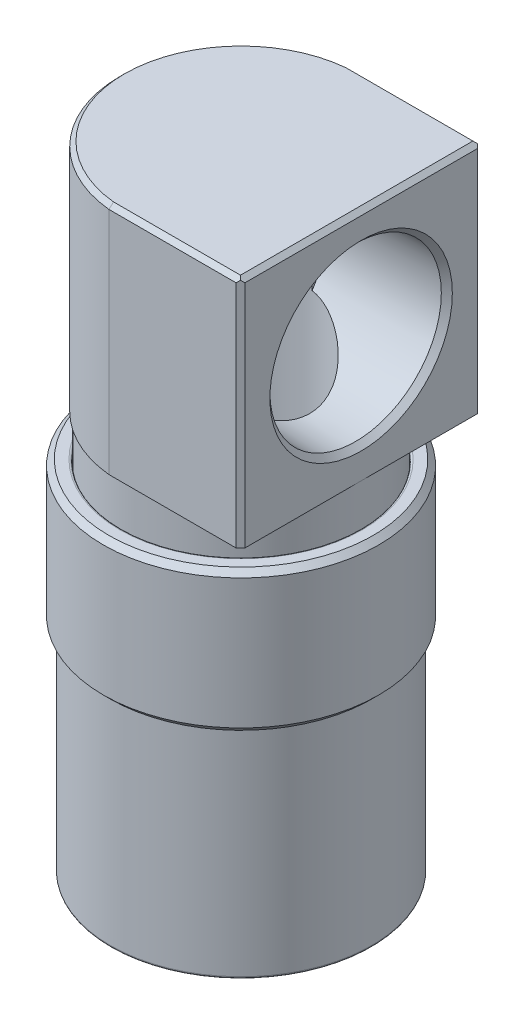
ISO-10303-21;
HEADER;
FILE_DESCRIPTION(('STEP AP214'),'2;1');
FILE_NAME('part.step','',(''),(''),'','','');
FILE_SCHEMA(('AUTOMOTIVE_DESIGN { 1 0 10303 214 1 1 1 1 }'));
ENDSEC;
DATA;
#1=APPLICATION_CONTEXT('core data for automotive mechanical design processes');
#2=APPLICATION_PROTOCOL_DEFINITION('international standard','automotive_design',2000,#1);
#3=PRODUCT_CONTEXT('',#1,'mechanical');
#4=PRODUCT('Part','Part','',(#3));
#5=PRODUCT_RELATED_PRODUCT_CATEGORY('part','',(#4));
#6=PRODUCT_DEFINITION_FORMATION('','',#4);
#7=PRODUCT_DEFINITION_CONTEXT('part definition',#1,'design');
#8=PRODUCT_DEFINITION('design','',#6,#7);
#9=PRODUCT_DEFINITION_SHAPE('','',#8);
#10=(LENGTH_UNIT() NAMED_UNIT(*) SI_UNIT(.MILLI.,.METRE.));
#11=(NAMED_UNIT(*) PLANE_ANGLE_UNIT() SI_UNIT($,.RADIAN.));
#12=(NAMED_UNIT(*) SI_UNIT($,.STERADIAN.) SOLID_ANGLE_UNIT());
#13=UNCERTAINTY_MEASURE_WITH_UNIT(LENGTH_MEASURE(1.E-05),#10,'distance_accuracy_value','');
#14=(GEOMETRIC_REPRESENTATION_CONTEXT(3) GLOBAL_UNCERTAINTY_ASSIGNED_CONTEXT((#13)) GLOBAL_UNIT_ASSIGNED_CONTEXT((#10,
#11,#12)) REPRESENTATION_CONTEXT('',''));
#15=CARTESIAN_POINT('',(0.,0.,0.));
#16=DIRECTION('',(0.,0.,1.));
#17=DIRECTION('',(1.,0.,0.));
#18=AXIS2_PLACEMENT_3D('',#15,#16,#17);
#19=CARTESIAN_POINT('',(0.,39.9288,0.));
#20=DIRECTION('',(0.,-1.,0.));
#21=DIRECTION('',(0.,0.,-1.));
#22=AXIS2_PLACEMENT_3D('',#19,#20,#21);
#23=CYLINDRICAL_SURFACE('',#22,7.9248);
#24=DIRECTION('',(0.,1.,0.));
#25=VECTOR('',#24,1.);
#26=CARTESIAN_POINT('',(0.,39.9288,7.9248));
#27=LINE('',#26,#25);
#28=CARTESIAN_POINT('',(0.,23.9776,7.9248));
#29=VERTEX_POINT('',#28);
#30=CARTESIAN_POINT('',(0.,46.0375,7.92479999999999));
#31=VERTEX_POINT('',#30);
#32=EDGE_CURVE('P0_E362',#29,#31,#27,.T.);
#33=ORIENTED_EDGE('',*,*,#32,.T.);
#34=ORIENTED_EDGE('',*,*,#32,.F.);
#35=CARTESIAN_POINT('',(0.,23.9776,0.));
#36=DIRECTION('',(0.,-1.,0.));
#37=DIRECTION('',(1.,0.,0.));
#38=AXIS2_PLACEMENT_3D('',#35,#36,#37);
#39=CIRCLE('',#38,7.9248);
#40=CARTESIAN_POINT('',(0.,23.9776,-7.9248));
#41=VERTEX_POINT('',#40);
#42=EDGE_CURVE('P0_E357',#29,#41,#39,.T.);
#43=ORIENTED_EDGE('',*,*,#42,.T.);
#44=CARTESIAN_POINT('',(0.,23.9776,0.));
#45=DIRECTION('',(0.,-1.,0.));
#46=DIRECTION('',(1.,0.,0.));
#47=AXIS2_PLACEMENT_3D('',#44,#45,#46);
#48=CIRCLE('',#47,7.9248);
#49=EDGE_CURVE('P0_E358',#41,#29,#48,.T.);
#50=ORIENTED_EDGE('',*,*,#49,.T.);
#51=EDGE_LOOP('',(#33,#34,#43,#50));
#52=FACE_BOUND('',#51,.T.);
#53=DIRECTION('',(0.,-1.,0.));
#54=VECTOR('',#53,1.);
#55=CARTESIAN_POINT('',(0.279400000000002,58.7375,7.91987314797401));
#56=LINE('',#55,#54);
#57=CARTESIAN_POINT('',(0.279400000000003,54.287059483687,7.91987314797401));
#58=VERTEX_POINT('',#57);
#59=CARTESIAN_POINT('',(0.279400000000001,55.4097722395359,7.91987314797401));
#60=VERTEX_POINT('',#59);
#61=EDGE_CURVE('P0_E236',#58,#60,#56,.F.);
#62=ORIENTED_EDGE('',*,*,#61,.F.);
#63=CARTESIAN_POINT('',(0.279200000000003,54.2870809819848,-7.91988020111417));
#64=CARTESIAN_POINT('',(0.4385256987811,54.2700519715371,-7.91429346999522));
#65=CARTESIAN_POINT('',(0.596727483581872,54.2457708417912,-7.90387475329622));
#66=CARTESIAN_POINT('',(0.909389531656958,54.1846664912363,-7.87400319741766));
#67=CARTESIAN_POINT('',(1.06385894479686,54.1478781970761,-7.85457546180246));
#68=CARTESIAN_POINT('',(1.36660054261,54.0641200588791,-7.80756644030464));
#69=CARTESIAN_POINT('',(1.51492531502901,54.017279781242,-7.78008742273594));
#70=CARTESIAN_POINT('',(1.80705493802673,53.9150933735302,-7.71746939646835));
#71=CARTESIAN_POINT('',(1.95085582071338,53.8597400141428,-7.68232386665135));
#72=CARTESIAN_POINT('',(2.30290410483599,53.7136331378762,-7.58596057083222));
#73=CARTESIAN_POINT('',(2.50827318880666,53.6188067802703,-7.52039826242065));
#74=CARTESIAN_POINT('',(2.90876500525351,53.4192944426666,-7.37475253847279));
#75=CARTESIAN_POINT('',(3.1038840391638,53.3146049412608,-7.29466392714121));
#76=CARTESIAN_POINT('',(3.4857243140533,53.0983818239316,-7.12015081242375));
#77=CARTESIAN_POINT('',(3.67237589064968,52.9868047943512,-7.02562832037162));
#78=CARTESIAN_POINT('',(4.03615130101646,52.7604872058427,-6.82314161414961));
#79=CARTESIAN_POINT('',(4.21327642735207,52.6457470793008,-6.71517923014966));
#80=CARTESIAN_POINT('',(4.56851048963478,52.4085821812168,-6.47914499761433));
#81=CARTESIAN_POINT('',(4.74604452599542,52.2861082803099,-6.35025656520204));
#82=CARTESIAN_POINT('',(5.09047749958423,52.0426642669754,-6.07764167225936));
#83=CARTESIAN_POINT('',(5.25737539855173,51.9216943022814,-5.93391376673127));
#84=CARTESIAN_POINT('',(5.57952419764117,51.6837833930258,-5.63204610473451));
#85=CARTESIAN_POINT('',(5.73480781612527,51.5668316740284,-5.47394984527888));
#86=CARTESIAN_POINT('',(6.03344612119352,51.3386137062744,-5.14292443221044));
#87=CARTESIAN_POINT('',(6.17679812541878,51.2273487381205,-4.96999196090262));
#88=CARTESIAN_POINT('',(6.4291118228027,51.0292653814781,-4.63740547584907));
#89=CARTESIAN_POINT('',(6.53996028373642,50.9413306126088,-4.47984679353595));
#90=CARTESIAN_POINT('',(6.75133038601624,50.7723265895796,-4.15446918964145));
#91=CARTESIAN_POINT('',(6.85185414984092,50.6912559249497,-3.9866523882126));
#92=CARTESIAN_POINT('',(7.04152326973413,50.5373188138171,-3.64118374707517));
#93=CARTESIAN_POINT('',(7.13067288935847,50.4644492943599,-3.46353562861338));
#94=CARTESIAN_POINT('',(7.29649083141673,50.3282321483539,-3.09899186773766));
#95=CARTESIAN_POINT('',(7.37316110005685,50.2648830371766,-2.9120976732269));
#96=CARTESIAN_POINT('',(7.50225678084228,50.1578072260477,-2.55898179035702));
#97=CARTESIAN_POINT('',(7.55659555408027,50.1125617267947,-2.39391858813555));
#98=CARTESIAN_POINT('',(7.65473796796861,50.0306353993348,-2.05862592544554));
#99=CARTESIAN_POINT('',(7.69854349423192,49.9939530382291,-1.88839739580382));
#100=CARTESIAN_POINT('',(7.77497410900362,49.9298344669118,-1.54381372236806));
#101=CARTESIAN_POINT('',(7.80760438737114,49.9023939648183,-1.36946053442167));
#102=CARTESIAN_POINT('',(7.86119379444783,49.8572767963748,-1.01771011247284));
#103=CARTESIAN_POINT('',(7.8821527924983,49.839600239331,-0.84031284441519));
#104=CARTESIAN_POINT('',(7.91208905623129,49.8143404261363,-0.483222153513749));
#105=CARTESIAN_POINT('',(7.92102821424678,49.8067892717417,-0.303523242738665));
#106=CARTESIAN_POINT('',(7.92664206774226,49.8020479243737,0.0562040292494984));
#107=CARTESIAN_POINT('',(7.92331674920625,49.8048577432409,0.236232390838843));
#108=CARTESIAN_POINT('',(7.90446097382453,49.8207773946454,0.595195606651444));
#109=CARTESIAN_POINT('',(7.88892989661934,49.833887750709,0.774130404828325));
#110=CARTESIAN_POINT('',(7.84593318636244,49.870129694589,1.12952500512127));
#111=CARTESIAN_POINT('',(7.81846768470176,49.8932611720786,1.30598483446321));
#112=CARTESIAN_POINT('',(7.75362285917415,49.9477572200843,1.646960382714));
#113=CARTESIAN_POINT('',(7.71677074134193,49.9786832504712,1.8116474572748));
#114=CARTESIAN_POINT('',(7.63314125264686,50.048679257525,2.13677272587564));
#115=CARTESIAN_POINT('',(7.58636008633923,50.087752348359,2.29720926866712));
#116=CARTESIAN_POINT('',(7.48346293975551,50.1734116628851,2.61301008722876));
#117=CARTESIAN_POINT('',(7.42734594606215,50.2199987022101,2.7683738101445));
#118=CARTESIAN_POINT('',(7.30640017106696,50.3200021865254,3.07341919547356));
#119=CARTESIAN_POINT('',(7.24156970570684,50.3734199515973,3.22309975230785));
#120=CARTESIAN_POINT('',(7.07905767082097,50.5066835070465,3.56901583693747));
#121=CARTESIAN_POINT('',(6.97794353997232,50.589127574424,3.76264887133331));
#122=CARTESIAN_POINT('',(6.76226335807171,50.7635347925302,4.13776469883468));
#123=CARTESIAN_POINT('',(6.6476931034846,50.8555009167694,4.31924366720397));
#124=CARTESIAN_POINT('',(6.40631914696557,51.0472824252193,4.66978210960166));
#125=CARTESIAN_POINT('',(6.27950231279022,51.1471062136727,4.83882790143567));
#126=CARTESIAN_POINT('',(6.01487211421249,51.3527972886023,5.16408055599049));
#127=CARTESIAN_POINT('',(5.87705959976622,51.458664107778,5.32028840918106));
#128=CARTESIAN_POINT('',(5.58909105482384,51.6764521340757,5.62216194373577));
#129=CARTESIAN_POINT('',(5.43877709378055,51.7884416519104,5.76762723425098));
#130=CARTESIAN_POINT('',(5.12833263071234,52.0151878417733,6.04533226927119));
#131=CARTESIAN_POINT('',(4.96820133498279,52.1299447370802,6.17757094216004));
#132=CARTESIAN_POINT('',(4.63833062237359,52.3604725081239,6.42894975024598));
#133=CARTESIAN_POINT('',(4.46858162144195,52.4762442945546,6.54807645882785));
#134=CARTESIAN_POINT('',(4.11971954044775,52.7065903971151,6.77299344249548));
#135=CARTESIAN_POINT('',(3.94060790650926,52.8211648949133,6.87878576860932));
#136=CARTESIAN_POINT('',(3.61031008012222,53.0236367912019,7.05661070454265));
#137=CARTESIAN_POINT('',(3.46087352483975,53.112211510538,7.13112919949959));
#138=CARTESIAN_POINT('',(3.15573259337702,53.2854659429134,7.27131308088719));
#139=CARTESIAN_POINT('',(3.00002938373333,53.3701463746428,7.33698010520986));
#140=CARTESIAN_POINT('',(2.68288257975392,53.5333161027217,7.45877376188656));
#141=CARTESIAN_POINT('',(2.52147208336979,53.611834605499,7.51494706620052));
#142=CARTESIAN_POINT('',(2.19195578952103,53.7608347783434,7.6175814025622));
#143=CARTESIAN_POINT('',(2.02385135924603,53.8313180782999,7.66404440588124));
#144=CARTESIAN_POINT('',(1.72824152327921,53.9434874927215,7.73511095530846));
#145=CARTESIAN_POINT('',(1.60231593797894,53.9877564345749,7.76220981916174));
#146=CARTESIAN_POINT('',(1.34718858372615,54.0693680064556,7.81053057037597));
#147=CARTESIAN_POINT('',(1.21798869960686,54.1067145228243,7.83175575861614));
#148=CARTESIAN_POINT('',(0.95529405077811,54.1735760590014,7.86813797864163));
#149=CARTESIAN_POINT('',(0.821769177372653,54.2030086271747,7.88323190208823));
#150=CARTESIAN_POINT('',(0.552162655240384,54.2524431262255,7.90670577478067));
#151=CARTESIAN_POINT('',(0.41607676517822,54.2724276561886,7.91507335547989));
#152=CARTESIAN_POINT('',(0.279199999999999,54.2870809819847,7.91988020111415));
#153=B_SPLINE_CURVE_WITH_KNOTS('',3,(#63,#64,#65,#66,#67,#68,#69,#70,#71,#72,#73,#74,#75,#76,
#77,#78,#79,#80,#81,#82,#83,#84,#85,#86,#87,#88,#89,#90,#91,#92,#93,#94,#95,#96,#97,#98,#99,
#100,#101,#102,#103,#104,#105,#106,#107,#108,#109,#110,#111,#112,#113,#114,#115,#116,#117,#118,
#119,#120,#121,#122,#123,#124,#125,#126,#127,#128,#129,#130,#131,#132,#133,#134,#135,#136,#137,
#138,#139,#140,#141,#142,#143,#144,#145,#146,#147,#148,#149,#150,#151,#152),.UNSPECIFIED.,.F.,
.F.,(4,2,2,2,2,2,2,2,2,2,2,2,2,2,2,2,2,2,2,2,2,2,2,2,2,2,2,2,2,2,2,2,2,2,2,2,2,2,2,2,2,2,2,2,4),
(0.,0.480495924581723,0.959660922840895,1.43298547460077,1.9067142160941,2.61213892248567,
3.31781644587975,4.0285171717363,4.73912122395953,5.49223082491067,6.24541382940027,
6.99638821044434,7.74753096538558,8.3822691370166,9.01687656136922,9.65124540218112,
10.2855152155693,10.8236803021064,11.3617489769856,11.899567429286,12.4373919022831,
12.9769175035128,13.5164437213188,14.0559973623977,14.5955450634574,15.1097087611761,
15.6240693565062,16.1384858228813,16.6530018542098,17.3524379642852,18.0520931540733,
18.7525071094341,19.4528669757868,20.1640577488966,20.8753060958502,21.5872761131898,
22.2991364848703,22.8658953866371,23.4325492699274,23.9963308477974,24.5599978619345,
24.9683130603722,25.3763983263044,25.7885835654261,26.2015250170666),.UNSPECIFIED.);
#154=CARTESIAN_POINT('',(0.279400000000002,54.287059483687,-7.91987314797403));
#155=VERTEX_POINT('',#154);
#156=EDGE_CURVE('P0_E231',#155,#58,#153,.T.);
#157=ORIENTED_EDGE('',*,*,#156,.F.);
#158=DIRECTION('',(0.,-1.,0.));
#159=VECTOR('',#158,1.);
#160=CARTESIAN_POINT('',(0.279400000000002,58.7375,-7.91987314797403));
#161=LINE('',#160,#159);
#162=CARTESIAN_POINT('',(0.279400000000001,55.4097722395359,-7.91987314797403));
#163=VERTEX_POINT('',#162);
#164=EDGE_CURVE('P0_E233',#163,#155,#161,.T.);
#165=ORIENTED_EDGE('',*,*,#164,.F.);
#166=CARTESIAN_POINT('',(0.279400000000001,55.4097722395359,7.91987314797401));
#167=CARTESIAN_POINT('',(0.164098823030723,55.4176876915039,7.923967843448));
#168=CARTESIAN_POINT('',(0.0483884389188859,55.4206205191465,7.9255028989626));
#169=CARTESIAN_POINT('',(-0.182645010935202,55.4167908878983,7.92352848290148));
#170=CARTESIAN_POINT('',(-0.297968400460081,55.4100441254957,7.9200271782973));
#171=CARTESIAN_POINT('',(-0.525429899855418,55.3873459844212,7.90817038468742));
#172=CARTESIAN_POINT('',(-0.637588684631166,55.3715548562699,7.89989938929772));
#173=CARTESIAN_POINT('',(-0.860010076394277,55.3317071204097,7.87878934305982));
#174=CARTESIAN_POINT('',(-0.97027188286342,55.3076471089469,7.86594841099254));
#175=CARTESIAN_POINT('',(-1.22820486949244,55.2421640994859,7.83048865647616));
#176=CARTESIAN_POINT('',(-1.37482528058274,55.1976090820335,7.80601149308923));
#177=CARTESIAN_POINT('',(-1.66291364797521,55.0977981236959,7.74975793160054));
#178=CARTESIAN_POINT('',(-1.80437906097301,55.042536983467,7.71797798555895));
#179=CARTESIAN_POINT('',(-2.08321094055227,54.9234025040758,7.64745287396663));
#180=CARTESIAN_POINT('',(-2.22053542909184,54.8594636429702,7.60865388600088));
#181=CARTESIAN_POINT('',(-2.49017998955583,54.725436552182,7.5247191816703));
#182=CARTESIAN_POINT('',(-2.62249791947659,54.6553457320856,7.47958079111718));
#183=CARTESIAN_POINT('',(-2.98403514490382,54.4542658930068,7.34568169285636));
#184=CARTESIAN_POINT('',(-3.20818863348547,54.3184844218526,7.25039367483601));
#185=CARTESIAN_POINT('',(-3.64340032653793,54.0398888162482,7.04175622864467));
#186=CARTESIAN_POINT('',(-3.8544491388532,53.8970697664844,6.92839404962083));
#187=CARTESIAN_POINT('',(-4.26436783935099,53.6090792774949,6.68390300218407));
#188=CARTESIAN_POINT('',(-4.4632353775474,53.4639073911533,6.5527707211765));
#189=CARTESIAN_POINT('',(-4.84890974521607,53.1748208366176,6.27274187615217));
#190=CARTESIAN_POINT('',(-5.03571977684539,53.030905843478,6.12385005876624));
#191=CARTESIAN_POINT('',(-5.40532279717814,52.7406422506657,5.80068658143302));
#192=CARTESIAN_POINT('',(-5.58752412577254,52.5944921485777,5.62555619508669));
#193=CARTESIAN_POINT('',(-5.93715906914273,52.3098871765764,5.25522950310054));
#194=CARTESIAN_POINT('',(-6.1045889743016,52.1714342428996,5.06002818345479));
#195=CARTESIAN_POINT('',(-6.42227764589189,51.9058582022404,4.65014346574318));
#196=CARTESIAN_POINT('',(-6.57258695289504,51.7787020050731,4.43552095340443));
#197=CARTESIAN_POINT('',(-6.85409262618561,51.538646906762,3.986717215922));
#198=CARTESIAN_POINT('',(-6.98530243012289,51.4257379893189,3.75254992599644));
#199=CARTESIAN_POINT('',(-7.18177676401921,51.2556846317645,3.3547341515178));
#200=CARTESIAN_POINT('',(-7.2536247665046,51.1932339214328,3.19656385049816));
#201=CARTESIAN_POINT('',(-7.38763289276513,51.0763960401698,2.8733121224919));
#202=CARTESIAN_POINT('',(-7.44979590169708,51.0220064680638,2.70823277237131));
#203=CARTESIAN_POINT('',(-7.5635905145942,50.9222041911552,2.37192947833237));
#204=CARTESIAN_POINT('',(-7.61522732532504,50.8767870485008,2.20070862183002));
#205=CARTESIAN_POINT('',(-7.70722220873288,50.7957296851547,1.85297617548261));
#206=CARTESIAN_POINT('',(-7.7475799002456,50.7600897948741,1.67646440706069));
#207=CARTESIAN_POINT('',(-7.8165349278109,50.6991227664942,1.31822272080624));
#208=CARTESIAN_POINT('',(-7.84505769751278,50.6738610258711,1.13646721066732));
#209=CARTESIAN_POINT('',(-7.88943964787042,50.6345277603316,0.770208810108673));
#210=CARTESIAN_POINT('',(-7.90529887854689,50.6204561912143,0.585705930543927));
#211=CARTESIAN_POINT('',(-7.92403421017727,50.6038307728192,0.2155643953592));
#212=CARTESIAN_POINT('',(-7.92691327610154,50.6012742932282,0.029926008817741));
#213=CARTESIAN_POINT('',(-7.91963602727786,50.6077335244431,-0.340884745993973));
#214=CARTESIAN_POINT('',(-7.90948055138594,50.6167484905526,-0.526057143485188));
#215=CARTESIAN_POINT('',(-7.87787397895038,50.644779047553,-0.877347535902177));
#216=CARTESIAN_POINT('',(-7.85754986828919,50.6627966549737,-1.04364914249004));
#217=CARTESIAN_POINT('',(-7.80665325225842,50.7078600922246,-1.37348981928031));
#218=CARTESIAN_POINT('',(-7.77607732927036,50.7349089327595,-1.53702794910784));
#219=CARTESIAN_POINT('',(-7.70514785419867,50.7975485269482,-1.8602484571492));
#220=CARTESIAN_POINT('',(-7.66479662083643,50.8331372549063,-2.0199317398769));
#221=CARTESIAN_POINT('',(-7.57485473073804,50.9122893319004,-2.33470335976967));
#222=CARTESIAN_POINT('',(-7.52526058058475,50.9558556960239,-2.48978993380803));
#223=CARTESIAN_POINT('',(-7.41484263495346,51.0525908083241,-2.80201473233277));
#224=CARTESIAN_POINT('',(-7.35359179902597,51.1061220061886,-2.95888955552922));
#225=CARTESIAN_POINT('',(-7.22233795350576,51.2204350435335,-3.26622827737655));
#226=CARTESIAN_POINT('',(-7.15233154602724,51.2812196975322,-3.41668965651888));
#227=CARTESIAN_POINT('',(-6.93026884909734,51.4732372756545,-3.85772732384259));
#228=CARTESIAN_POINT('',(-6.76610210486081,51.6141928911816,-4.13814302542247));
#229=CARTESIAN_POINT('',(-6.45420625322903,51.8787831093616,-4.60480967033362));
#230=CARTESIAN_POINT('',(-6.31219202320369,51.9982910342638,-4.79737417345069));
#231=CARTESIAN_POINT('',(-6.01448798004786,52.2459398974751,-5.16569665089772));
#232=CARTESIAN_POINT('',(-5.85879689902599,52.3740816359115,-5.34145306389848));
#233=CARTESIAN_POINT('',(-5.53452636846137,52.6370172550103,-5.67680478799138));
#234=CARTESIAN_POINT('',(-5.36590064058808,52.7718343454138,-5.83633681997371));
#235=CARTESIAN_POINT('',(-5.01719285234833,53.045187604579,-6.13868675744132));
#236=CARTESIAN_POINT('',(-4.83711317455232,53.1837229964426,-6.28150812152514));
#237=CARTESIAN_POINT('',(-4.46159377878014,53.4650749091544,-6.55375181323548));
#238=CARTESIAN_POINT('',(-4.26589694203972,53.6079168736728,-6.68279293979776));
#239=CARTESIAN_POINT('',(-3.86253580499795,53.8914746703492,-6.92376435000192));
#240=CARTESIAN_POINT('',(-3.65486445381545,54.0321891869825,-7.03568440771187));
#241=CARTESIAN_POINT('',(-3.22748093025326,54.3064711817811,-7.24168028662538));
#242=CARTESIAN_POINT('',(-3.00781326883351,54.440061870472,-7.33581696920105));
#243=CARTESIAN_POINT('',(-2.55442769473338,54.69406550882,-7.50572256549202));
#244=CARTESIAN_POINT('',(-2.32073066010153,54.8144973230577,-7.58151796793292));
#245=CARTESIAN_POINT('',(-1.86047647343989,55.0221628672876,-7.70664428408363));
#246=CARTESIAN_POINT('',(-1.63538664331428,55.1114734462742,-7.75781694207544));
#247=CARTESIAN_POINT('',(-1.17306563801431,55.2607183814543,-7.84097854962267));
#248=CARTESIAN_POINT('',(-0.935907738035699,55.3208110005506,-7.87307106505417));
#249=CARTESIAN_POINT('',(-0.534909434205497,55.3875961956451,-7.90835011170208));
#250=CARTESIAN_POINT('',(-0.373496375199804,55.4054894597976,-7.91764991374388));
#251=CARTESIAN_POINT('',(-0.129782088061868,55.4180191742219,-7.92416007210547));
#252=CARTESIAN_POINT('',(-0.0478994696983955,55.4197854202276,-7.92507704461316));
#253=CARTESIAN_POINT('',(0.115853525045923,55.4184409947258,-7.92437728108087));
#254=CARTESIAN_POINT('',(0.197723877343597,55.4153280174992,-7.92275934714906));
#255=CARTESIAN_POINT('',(0.279400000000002,55.4097722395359,-7.91987314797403));
#256=B_SPLINE_CURVE_WITH_KNOTS('',3,(#166,#167,#168,#169,#170,#171,#172,#173,#174,#175,#176,
#177,#178,#179,#180,#181,#182,#183,#184,#185,#186,#187,#188,#189,#190,#191,#192,#193,#194,#195,
#196,#197,#198,#199,#200,#201,#202,#203,#204,#205,#206,#207,#208,#209,#210,#211,#212,#213,#214,
#215,#216,#217,#218,#219,#220,#221,#222,#223,#224,#225,#226,#227,#228,#229,#230,#231,#232,#233,
#234,#235,#236,#237,#238,#239,#240,#241,#242,#243,#244,#245,#246,#247,#248,#249,#250,#251,#252,
#253,#254,#255),.UNSPECIFIED.,.F.,.F.,(4,2,2,2,2,2,2,2,2,2,2,2,2,2,2,2,2,2,2,2,2,2,2,2,2,2,2,2,
2,2,2,2,2,2,2,2,2,2,2,2,2,2,2,2,4),(0.,0.346768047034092,0.692974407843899,1.03322839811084,
1.37362261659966,1.83838356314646,2.30337078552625,2.7720875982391,3.24100272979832,
4.07629854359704,4.91218626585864,5.74823474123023,6.58406026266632,7.45878829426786,
8.33373537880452,9.20602871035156,10.0777053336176,10.6310411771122,11.1842118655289,
11.7371082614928,12.2900233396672,12.8463710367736,13.4027165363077,13.9589349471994,
14.5151175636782,15.0200539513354,15.5251588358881,16.0301440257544,16.5353204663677,
17.0649241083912,17.5947339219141,18.6537404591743,19.455152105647,20.2566381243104,
21.0611390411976,21.8654731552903,22.6882049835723,23.511426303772,24.3317770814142,
25.1509359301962,25.8914772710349,26.6279614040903,27.1145456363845,27.3600975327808,
27.6057655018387),.UNSPECIFIED.);
#257=EDGE_CURVE('P0_E249',#60,#163,#256,.T.);
#258=ORIENTED_EDGE('',*,*,#257,.F.);
#259=EDGE_LOOP('',(#62,#157,#165,#258));
#260=FACE_BOUND('',#259,.T.);
#261=ADVANCED_FACE('P0_F45',(#52,#260),#23,.F.);
#262=CARTESIAN_POINT('',(0.,43.0403,0.));
#263=DIRECTION('',(0.,-1.,0.));
#264=DIRECTION('',(0.,0.,-1.));
#265=AXIS2_PLACEMENT_3D('',#262,#263,#264);
#266=CYLINDRICAL_SURFACE('',#265,13.7414);
#267=DIRECTION('',(0.,1.,0.));
#268=VECTOR('',#267,1.);
#269=CARTESIAN_POINT('',(0.,43.0403,13.7414));
#270=LINE('',#269,#268);
#271=CARTESIAN_POINT('',(0.,16.4846,13.7414));
#272=VERTEX_POINT('',#271);
#273=CARTESIAN_POINT('',(0.,46.0375,13.7414));
#274=VERTEX_POINT('',#273);
#275=EDGE_CURVE('P0_E344',#272,#274,#270,.T.);
#276=ORIENTED_EDGE('',*,*,#275,.T.);
#277=CARTESIAN_POINT('',(0.,46.0375,0.));
#278=DIRECTION('',(0.,1.,0.));
#279=DIRECTION('',(0.,0.,1.));
#280=AXIS2_PLACEMENT_3D('',#277,#278,#279);
#281=CIRCLE('',#280,13.7414);
#282=EDGE_CURVE('P0_E279',#274,#274,#281,.F.);
#283=ORIENTED_EDGE('',*,*,#282,.T.);
#284=ORIENTED_EDGE('',*,*,#275,.F.);
#285=CARTESIAN_POINT('',(0.,16.4846,0.));
#286=DIRECTION('',(0.,-1.,0.));
#287=DIRECTION('',(0.,0.,1.));
#288=AXIS2_PLACEMENT_3D('',#285,#286,#287);
#289=CIRCLE('',#288,13.7414);
#290=CARTESIAN_POINT('',(0.,16.4846,-13.7414));
#291=VERTEX_POINT('',#290);
#292=EDGE_CURVE('P0_E343',#291,#272,#289,.T.);
#293=ORIENTED_EDGE('',*,*,#292,.F.);
#294=CARTESIAN_POINT('',(0.,16.4846,0.));
#295=DIRECTION('',(0.,-1.,0.));
#296=DIRECTION('',(0.,0.,1.));
#297=AXIS2_PLACEMENT_3D('',#294,#295,#296);
#298=CIRCLE('',#297,13.7414);
#299=EDGE_CURVE('P0_E350',#272,#291,#298,.T.);
#300=ORIENTED_EDGE('',*,*,#299,.F.);
#301=EDGE_LOOP('',(#276,#283,#284,#293,#300));
#302=FACE_BOUND('',#301,.T.);
#303=ADVANCED_FACE('P0_F463',(#302),#266,.T.);
#304=CARTESIAN_POINT('',(0.,0.254,0.));
#305=DIRECTION('',(0.,-1.,0.));
#306=DIRECTION('',(0.,0.,-1.));
#307=AXIS2_PLACEMENT_3D('',#304,#305,#306);
#308=TOROIDAL_SURFACE('',#307,10.287,0.254);
#309=CARTESIAN_POINT('',(0.,0.254,0.));
#310=DIRECTION('',(0.,1.,0.));
#311=DIRECTION('',(0.,0.,1.));
#312=AXIS2_PLACEMENT_3D('',#309,#310,#311);
#313=CIRCLE('',#312,10.033);
#314=CARTESIAN_POINT('',(0.,0.254,-10.033));
#315=VERTEX_POINT('',#314);
#316=CARTESIAN_POINT('',(0.,0.254,10.033));
#317=VERTEX_POINT('',#316);
#318=EDGE_CURVE('P0_E241',#315,#317,#313,.T.);
#319=ORIENTED_EDGE('',*,*,#318,.T.);
#320=CARTESIAN_POINT('',(0.,0.254,10.287));
#321=DIRECTION('',(-1.,0.,0.));
#322=DIRECTION('',(0.,0.,1.));
#323=AXIS2_PLACEMENT_3D('',#320,#321,#322);
#324=CIRCLE('',#323,0.254);
#325=CARTESIAN_POINT('',(0.,0.,10.287));
#326=VERTEX_POINT('',#325);
#327=EDGE_CURVE('P0_E329',#317,#326,#324,.T.);
#328=ORIENTED_EDGE('',*,*,#327,.T.);
#329=CARTESIAN_POINT('',(0.,0.,0.));
#330=DIRECTION('',(0.,-1.,0.));
#331=DIRECTION('',(0.,0.,1.));
#332=AXIS2_PLACEMENT_3D('',#329,#330,#331);
#333=CIRCLE('',#332,10.287);
#334=CARTESIAN_POINT('',(0.,0.,-10.287));
#335=VERTEX_POINT('',#334);
#336=EDGE_CURVE('P0_E349',#326,#335,#333,.T.);
#337=ORIENTED_EDGE('',*,*,#336,.T.);
#338=CARTESIAN_POINT('',(0.,0.,0.));
#339=DIRECTION('',(0.,-1.,0.));
#340=DIRECTION('',(0.,0.,1.));
#341=AXIS2_PLACEMENT_3D('',#338,#339,#340);
#342=CIRCLE('',#341,10.287);
#343=EDGE_CURVE('P0_E345',#335,#326,#342,.T.);
#344=ORIENTED_EDGE('',*,*,#343,.T.);
#345=ORIENTED_EDGE('',*,*,#327,.F.);
#346=CARTESIAN_POINT('',(0.,0.254,0.));
#347=DIRECTION('',(0.,1.,0.));
#348=DIRECTION('',(0.,0.,1.));
#349=AXIS2_PLACEMENT_3D('',#346,#347,#348);
#350=CIRCLE('',#349,10.033);
#351=EDGE_CURVE('P0_E319',#317,#315,#350,.T.);
#352=ORIENTED_EDGE('',*,*,#351,.T.);
#353=EDGE_LOOP('',(#319,#328,#337,#344,#345,#352));
#354=FACE_BOUND('',#353,.T.);
#355=ADVANCED_FACE('P0_F468',(#354),#308,.T.);
#356=CARTESIAN_POINT('',(0.,0.,-10.033));
#357=DIRECTION('',(0.,-1.,0.));
#358=DIRECTION('',(0.,0.,-1.));
#359=AXIS2_PLACEMENT_3D('',#356,#357,#358);
#360=PLANE('',#359);
#361=CARTESIAN_POINT('',(0.,0.,0.));
#362=DIRECTION('',(0.,1.,0.));
#363=DIRECTION('',(0.,0.,1.));
#364=AXIS2_PLACEMENT_3D('',#361,#362,#363);
#365=CIRCLE('',#364,11.8618);
#366=CARTESIAN_POINT('',(0.,0.,-11.8618));
#367=VERTEX_POINT('',#366);
#368=CARTESIAN_POINT('',(0.,0.,11.8618));
#369=VERTEX_POINT('',#368);
#370=EDGE_CURVE('P0_E320',#367,#369,#365,.T.);
#371=ORIENTED_EDGE('',*,*,#370,.F.);
#372=CARTESIAN_POINT('',(0.,0.,0.));
#373=DIRECTION('',(0.,1.,0.));
#374=DIRECTION('',(0.,0.,1.));
#375=AXIS2_PLACEMENT_3D('',#372,#373,#374);
#376=CIRCLE('',#375,11.8618);
#377=EDGE_CURVE('P0_E302',#369,#367,#376,.T.);
#378=ORIENTED_EDGE('',*,*,#377,.F.);
#379=EDGE_LOOP('',(#371,#378));
#380=FACE_BOUND('',#379,.T.);
#381=ORIENTED_EDGE('',*,*,#343,.F.);
#382=ORIENTED_EDGE('',*,*,#336,.F.);
#383=EDGE_LOOP('',(#381,#382));
#384=FACE_BOUND('',#383,.T.);
#385=ADVANCED_FACE('P0_F476',(#380,#384),#360,.T.);
#386=CARTESIAN_POINT('',(0.,8.5344,0.));
#387=DIRECTION('',(0.,-1.,0.));
#388=DIRECTION('',(0.,0.,-1.));
#389=AXIS2_PLACEMENT_3D('',#386,#387,#388);
#390=CYLINDRICAL_SURFACE('',#389,10.033);
#391=ORIENTED_EDGE('',*,*,#318,.F.);
#392=ORIENTED_EDGE('',*,*,#351,.F.);
#393=DIRECTION('',(0.,1.,0.));
#394=VECTOR('',#393,1.);
#395=CARTESIAN_POINT('',(0.,8.5344,10.033));
#396=LINE('',#395,#394);
#397=CARTESIAN_POINT('',(0.,17.0688,10.033));
#398=VERTEX_POINT('',#397);
#399=EDGE_CURVE('P0_E315',#317,#398,#396,.T.);
#400=ORIENTED_EDGE('',*,*,#399,.T.);
#401=CARTESIAN_POINT('',(0.,17.0688,0.));
#402=DIRECTION('',(0.,-1.,0.));
#403=DIRECTION('',(1.,0.,0.));
#404=AXIS2_PLACEMENT_3D('',#401,#402,#403);
#405=CIRCLE('',#404,10.033);
#406=CARTESIAN_POINT('',(0.,17.0688,-10.033));
#407=VERTEX_POINT('',#406);
#408=EDGE_CURVE('P0_E353',#407,#398,#405,.T.);
#409=ORIENTED_EDGE('',*,*,#408,.F.);
#410=CARTESIAN_POINT('',(0.,17.0688,0.));
#411=DIRECTION('',(0.,-1.,0.));
#412=DIRECTION('',(1.,0.,0.));
#413=AXIS2_PLACEMENT_3D('',#410,#411,#412);
#414=CIRCLE('',#413,10.033);
#415=EDGE_CURVE('P0_E309',#398,#407,#414,.T.);
#416=ORIENTED_EDGE('',*,*,#415,.F.);
#417=ORIENTED_EDGE('',*,*,#399,.F.);
#418=EDGE_LOOP('',(#391,#392,#400,#409,#416,#417));
#419=FACE_BOUND('',#418,.T.);
#420=ADVANCED_FACE('P0_F472',(#419),#390,.F.);
#421=CARTESIAN_POINT('',(0.,0.254,0.));
#422=DIRECTION('',(0.,-1.,0.));
#423=DIRECTION('',(0.,0.,-1.));
#424=AXIS2_PLACEMENT_3D('',#421,#422,#423);
#425=TOROIDAL_SURFACE('',#424,11.8618,0.254);
#426=ORIENTED_EDGE('',*,*,#370,.T.);
#427=CARTESIAN_POINT('',(0.,0.254,11.8618));
#428=DIRECTION('',(-1.,0.,0.));
#429=DIRECTION('',(0.,0.,1.));
#430=AXIS2_PLACEMENT_3D('',#427,#428,#429);
#431=CIRCLE('',#430,0.254);
#432=CARTESIAN_POINT('',(0.,0.254,12.1158));
#433=VERTEX_POINT('',#432);
#434=EDGE_CURVE('P0_E366',#369,#433,#431,.T.);
#435=ORIENTED_EDGE('',*,*,#434,.T.);
#436=CARTESIAN_POINT('',(0.,0.254,0.));
#437=DIRECTION('',(0.,-1.,0.));
#438=DIRECTION('',(0.,0.,1.));
#439=AXIS2_PLACEMENT_3D('',#436,#437,#438);
#440=CIRCLE('',#439,12.1158);
#441=CARTESIAN_POINT('',(0.,0.254,-12.1158));
#442=VERTEX_POINT('',#441);
#443=EDGE_CURVE('P0_E301',#433,#442,#440,.T.);
#444=ORIENTED_EDGE('',*,*,#443,.T.);
#445=CARTESIAN_POINT('',(0.,0.254,0.));
#446=DIRECTION('',(0.,-1.,0.));
#447=DIRECTION('',(0.,0.,1.));
#448=AXIS2_PLACEMENT_3D('',#445,#446,#447);
#449=CIRCLE('',#448,12.1158);
#450=EDGE_CURVE('P0_E298',#442,#433,#449,.T.);
#451=ORIENTED_EDGE('',*,*,#450,.T.);
#452=ORIENTED_EDGE('',*,*,#434,.F.);
#453=ORIENTED_EDGE('',*,*,#377,.T.);
#454=EDGE_LOOP('',(#426,#435,#444,#451,#452,#453));
#455=FACE_BOUND('',#454,.T.);
#456=ADVANCED_FACE('P0_F475',(#455),#425,.T.);
#457=CARTESIAN_POINT('',(0.,8.1153,0.));
#458=DIRECTION('',(0.,-1.,0.));
#459=DIRECTION('',(0.,0.,-1.));
#460=AXIS2_PLACEMENT_3D('',#457,#458,#459);
#461=CYLINDRICAL_SURFACE('',#460,12.1158);
#462=ORIENTED_EDGE('',*,*,#450,.F.);
#463=ORIENTED_EDGE('',*,*,#443,.F.);
#464=DIRECTION('',(0.,1.,0.));
#465=VECTOR('',#464,1.);
#466=CARTESIAN_POINT('',(0.,8.1153,12.1158));
#467=LINE('',#466,#465);
#468=CARTESIAN_POINT('',(0.,15.9766,12.1158));
#469=VERTEX_POINT('',#468);
#470=EDGE_CURVE('P0_E307',#433,#469,#467,.T.);
#471=ORIENTED_EDGE('',*,*,#470,.T.);
#472=CARTESIAN_POINT('',(0.,15.9766,0.));
#473=DIRECTION('',(0.,1.,0.));
#474=DIRECTION('',(0.,0.,1.));
#475=AXIS2_PLACEMENT_3D('',#472,#473,#474);
#476=CIRCLE('',#475,12.1158);
#477=CARTESIAN_POINT('',(0.,15.9766,-12.1158));
#478=VERTEX_POINT('',#477);
#479=EDGE_CURVE('P0_E325',#478,#469,#476,.T.);
#480=ORIENTED_EDGE('',*,*,#479,.F.);
#481=CARTESIAN_POINT('',(0.,15.9766,0.));
#482=DIRECTION('',(0.,1.,0.));
#483=DIRECTION('',(0.,0.,1.));
#484=AXIS2_PLACEMENT_3D('',#481,#482,#483);
#485=CIRCLE('',#484,12.1158);
#486=EDGE_CURVE('P0_E321',#469,#478,#485,.T.);
#487=ORIENTED_EDGE('',*,*,#486,.F.);
#488=ORIENTED_EDGE('',*,*,#470,.F.);
#489=EDGE_LOOP('',(#462,#463,#471,#480,#487,#488));
#490=FACE_BOUND('',#489,.T.);
#491=ADVANCED_FACE('P0_F480',(#490),#461,.T.);
#492=CARTESIAN_POINT('',(0.,15.9766,0.));
#493=DIRECTION('',(0.,-1.,0.));
#494=DIRECTION('',(0.,0.,-1.));
#495=AXIS2_PLACEMENT_3D('',#492,#493,#494);
#496=TOROIDAL_SURFACE('',#495,12.3698,0.254);
#497=CARTESIAN_POINT('',(0.,16.2306,0.));
#498=DIRECTION('',(0.,-1.,0.));
#499=DIRECTION('',(0.,0.,1.));
#500=AXIS2_PLACEMENT_3D('',#497,#498,#499);
#501=CIRCLE('',#500,12.3698);
#502=CARTESIAN_POINT('',(0.,16.2306,-12.3698));
#503=VERTEX_POINT('',#502);
#504=CARTESIAN_POINT('',(0.,16.2306,12.3698));
#505=VERTEX_POINT('',#504);
#506=EDGE_CURVE('P0_E303',#503,#505,#501,.T.);
#507=ORIENTED_EDGE('',*,*,#506,.T.);
#508=CARTESIAN_POINT('',(0.,15.9766,12.3698));
#509=DIRECTION('',(-1.,0.,0.));
#510=DIRECTION('',(0.,0.,1.));
#511=AXIS2_PLACEMENT_3D('',#508,#509,#510);
#512=CIRCLE('',#511,0.254);
#513=EDGE_CURVE('P0_E308',#505,#469,#512,.T.);
#514=ORIENTED_EDGE('',*,*,#513,.T.);
#515=ORIENTED_EDGE('',*,*,#486,.T.);
#516=ORIENTED_EDGE('',*,*,#479,.T.);
#517=ORIENTED_EDGE('',*,*,#513,.F.);
#518=CARTESIAN_POINT('',(0.,16.2306,0.));
#519=DIRECTION('',(0.,-1.,0.));
#520=DIRECTION('',(0.,0.,1.));
#521=AXIS2_PLACEMENT_3D('',#518,#519,#520);
#522=CIRCLE('',#521,12.3698);
#523=EDGE_CURVE('P0_E291',#505,#503,#522,.T.);
#524=ORIENTED_EDGE('',*,*,#523,.T.);
#525=EDGE_LOOP('',(#507,#514,#515,#516,#517,#524));
#526=FACE_BOUND('',#525,.T.);
#527=ADVANCED_FACE('P0_F495',(#526),#496,.F.);
#528=CARTESIAN_POINT('',(0.,16.2306,-12.1158));
#529=DIRECTION('',(0.,-1.,0.));
#530=DIRECTION('',(0.,0.,-1.));
#531=AXIS2_PLACEMENT_3D('',#528,#529,#530);
#532=PLANE('',#531);
#533=CARTESIAN_POINT('',(0.,16.2306,0.));
#534=DIRECTION('',(0.,1.,0.));
#535=DIRECTION('',(0.,0.,1.));
#536=AXIS2_PLACEMENT_3D('',#533,#534,#535);
#537=CIRCLE('',#536,13.4874);
#538=CARTESIAN_POINT('',(0.,16.2306,-13.4874));
#539=VERTEX_POINT('',#538);
#540=CARTESIAN_POINT('',(0.,16.2306,13.4874));
#541=VERTEX_POINT('',#540);
#542=EDGE_CURVE('P0_E287',#539,#541,#537,.T.);
#543=ORIENTED_EDGE('',*,*,#542,.F.);
#544=CARTESIAN_POINT('',(0.,16.2306,0.));
#545=DIRECTION('',(0.,1.,0.));
#546=DIRECTION('',(0.,0.,1.));
#547=AXIS2_PLACEMENT_3D('',#544,#545,#546);
#548=CIRCLE('',#547,13.4874);
#549=EDGE_CURVE('P0_E339',#541,#539,#548,.T.);
#550=ORIENTED_EDGE('',*,*,#549,.F.);
#551=EDGE_LOOP('',(#543,#550));
#552=FACE_BOUND('',#551,.T.);
#553=ORIENTED_EDGE('',*,*,#506,.F.);
#554=ORIENTED_EDGE('',*,*,#523,.F.);
#555=EDGE_LOOP('',(#553,#554));
#556=FACE_BOUND('',#555,.T.);
#557=ADVANCED_FACE('P0_F493',(#552,#556),#532,.T.);
#558=CARTESIAN_POINT('',(0.,16.4846,0.));
#559=DIRECTION('',(0.,-1.,0.));
#560=DIRECTION('',(0.,0.,-1.));
#561=AXIS2_PLACEMENT_3D('',#558,#559,#560);
#562=TOROIDAL_SURFACE('',#561,13.4874,0.254);
#563=ORIENTED_EDGE('',*,*,#542,.T.);
#564=CARTESIAN_POINT('',(0.,16.4846,13.4874));
#565=DIRECTION('',(-1.,0.,0.));
#566=DIRECTION('',(0.,0.,1.));
#567=AXIS2_PLACEMENT_3D('',#564,#565,#566);
#568=CIRCLE('',#567,0.254);
#569=EDGE_CURVE('P0_E292',#541,#272,#568,.T.);
#570=ORIENTED_EDGE('',*,*,#569,.T.);
#571=ORIENTED_EDGE('',*,*,#299,.T.);
#572=ORIENTED_EDGE('',*,*,#292,.T.);
#573=ORIENTED_EDGE('',*,*,#569,.F.);
#574=ORIENTED_EDGE('',*,*,#549,.T.);
#575=EDGE_LOOP('',(#563,#570,#571,#572,#573,#574));
#576=FACE_BOUND('',#575,.T.);
#577=ADVANCED_FACE('P0_F490',(#576),#562,.T.);
#578=CARTESIAN_POINT('',(0.,17.3863,0.));
#579=DIRECTION('',(0.,1.,0.));
#580=DIRECTION('',(0.,0.,-1.));
#581=AXIS2_PLACEMENT_3D('',#578,#579,#580);
#582=CONICAL_SURFACE('',#581,10.3505,0.78539816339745);
#583=ORIENTED_EDGE('',*,*,#408,.T.);
#584=DIRECTION('',(0.,0.707106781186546,0.707106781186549));
#585=VECTOR('',#584,1.);
#586=CARTESIAN_POINT('',(0.,17.3863,10.3505));
#587=LINE('',#586,#585);
#588=CARTESIAN_POINT('',(0.,17.7038,10.668));
#589=VERTEX_POINT('',#588);
#590=EDGE_CURVE('P0_E313',#398,#589,#587,.T.);
#591=ORIENTED_EDGE('',*,*,#590,.T.);
#592=CARTESIAN_POINT('',(0.,17.7038,0.));
#593=DIRECTION('',(0.,-1.,0.));
#594=DIRECTION('',(1.,0.,0.));
#595=AXIS2_PLACEMENT_3D('',#592,#593,#594);
#596=CIRCLE('',#595,10.668);
#597=CARTESIAN_POINT('',(0.,17.7038,-10.668));
#598=VERTEX_POINT('',#597);
#599=EDGE_CURVE('P0_E314',#598,#589,#596,.T.);
#600=ORIENTED_EDGE('',*,*,#599,.F.);
#601=CARTESIAN_POINT('',(0.,17.7038,0.));
#602=DIRECTION('',(0.,-1.,0.));
#603=DIRECTION('',(1.,0.,0.));
#604=AXIS2_PLACEMENT_3D('',#601,#602,#603);
#605=CIRCLE('',#604,10.668);
#606=EDGE_CURVE('P0_E293',#589,#598,#605,.T.);
#607=ORIENTED_EDGE('',*,*,#606,.F.);
#608=ORIENTED_EDGE('',*,*,#590,.F.);
#609=ORIENTED_EDGE('',*,*,#415,.T.);
#610=EDGE_LOOP('',(#583,#591,#600,#607,#608,#609));
#611=FACE_BOUND('',#610,.T.);
#612=ADVANCED_FACE('P0_F488',(#611),#582,.F.);
#613=CARTESIAN_POINT('',(0.,20.8407,0.));
#614=DIRECTION('',(0.,-1.,0.));
#615=DIRECTION('',(0.,0.,-1.));
#616=AXIS2_PLACEMENT_3D('',#613,#614,#615);
#617=CYLINDRICAL_SURFACE('',#616,10.668);
#618=ORIENTED_EDGE('',*,*,#599,.T.);
#619=DIRECTION('',(0.,1.,0.));
#620=VECTOR('',#619,1.);
#621=CARTESIAN_POINT('',(0.,20.8407,10.668));
#622=LINE('',#621,#620);
#623=CARTESIAN_POINT('',(0.,23.9776,10.668));
#624=VERTEX_POINT('',#623);
#625=EDGE_CURVE('P0_E297',#589,#624,#622,.T.);
#626=ORIENTED_EDGE('',*,*,#625,.T.);
#627=CARTESIAN_POINT('',(0.,23.9776,0.));
#628=DIRECTION('',(0.,-1.,0.));
#629=DIRECTION('',(1.,0.,0.));
#630=AXIS2_PLACEMENT_3D('',#627,#628,#629);
#631=CIRCLE('',#630,10.668);
#632=CARTESIAN_POINT('',(0.,23.9776,-10.668));
#633=VERTEX_POINT('',#632);
#634=EDGE_CURVE('P0_E286',#633,#624,#631,.T.);
#635=ORIENTED_EDGE('',*,*,#634,.F.);
#636=CARTESIAN_POINT('',(0.,23.9776,0.));
#637=DIRECTION('',(0.,-1.,0.));
#638=DIRECTION('',(1.,0.,0.));
#639=AXIS2_PLACEMENT_3D('',#636,#637,#638);
#640=CIRCLE('',#639,10.668);
#641=EDGE_CURVE('P0_E282',#624,#633,#640,.T.);
#642=ORIENTED_EDGE('',*,*,#641,.F.);
#643=ORIENTED_EDGE('',*,*,#625,.F.);
#644=ORIENTED_EDGE('',*,*,#606,.T.);
#645=EDGE_LOOP('',(#618,#626,#635,#642,#643,#644));
#646=FACE_BOUND('',#645,.T.);
#647=ADVANCED_FACE('P0_F485',(#646),#617,.F.);
#648=CARTESIAN_POINT('',(0.,23.9776,-7.9248));
#649=DIRECTION('',(0.,-1.,0.));
#650=DIRECTION('',(0.,0.,-1.));
#651=AXIS2_PLACEMENT_3D('',#648,#649,#650);
#652=PLANE('',#651);
#653=ORIENTED_EDGE('',*,*,#634,.T.);
#654=ORIENTED_EDGE('',*,*,#641,.T.);
#655=EDGE_LOOP('',(#653,#654));
#656=FACE_BOUND('',#655,.T.);
#657=ORIENTED_EDGE('',*,*,#49,.F.);
#658=ORIENTED_EDGE('',*,*,#42,.F.);
#659=EDGE_LOOP('',(#657,#658));
#660=FACE_BOUND('',#659,.T.);
#661=ADVANCED_FACE('P0_F445',(#656,#660),#652,.T.);
#662=CARTESIAN_POINT('',(0.,73.025,-12.192));
#663=DIRECTION('',(0.,-1.,0.));
#664=DIRECTION('',(0.,0.,-1.));
#665=AXIS2_PLACEMENT_3D('',#662,#663,#664);
#666=PLANE('',#665);
#667=DIRECTION('',(-1.,0.,0.));
#668=VECTOR('',#667,1.);
#669=CARTESIAN_POINT('',(-1.33047275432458,73.025,-13.3985));
#670=LINE('',#669,#668);
#671=CARTESIAN_POINT('',(13.335,73.025,-13.3985));
#672=VERTEX_POINT('',#671);
#673=CARTESIAN_POINT('',(-1.3060022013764,73.025,-13.3985));
#674=VERTEX_POINT('',#673);
#675=EDGE_CURVE('P0_E602',#672,#674,#670,.T.);
#676=ORIENTED_EDGE('',*,*,#675,.T.);
#677=CARTESIAN_POINT('',(0.,73.025,0.));
#678=DIRECTION('',(0.,-1.,0.));
#679=DIRECTION('',(0.,0.,-1.));
#680=AXIS2_PLACEMENT_3D('',#677,#678,#679);
#681=CIRCLE('',#680,13.462);
#682=CARTESIAN_POINT('',(-1.3060022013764,73.025,13.3985));
#683=VERTEX_POINT('',#682);
#684=EDGE_CURVE('P0_E610',#674,#683,#681,.F.);
#685=ORIENTED_EDGE('',*,*,#684,.T.);
#686=DIRECTION('',(1.,0.,0.));
#687=VECTOR('',#686,1.);
#688=CARTESIAN_POINT('',(13.843,73.025,13.3985));
#689=LINE('',#688,#687);
#690=CARTESIAN_POINT('',(13.335,73.025,13.3985));
#691=VERTEX_POINT('',#690);
#692=EDGE_CURVE('P0_E618',#683,#691,#689,.T.);
#693=ORIENTED_EDGE('',*,*,#692,.T.);
#694=DIRECTION('',(0.,0.,-1.));
#695=VECTOR('',#694,1.);
#696=CARTESIAN_POINT('',(13.335,73.025,-13.9065));
#697=LINE('',#696,#695);
#698=EDGE_CURVE('P0_E616',#691,#672,#697,.T.);
#699=ORIENTED_EDGE('',*,*,#698,.T.);
#700=EDGE_LOOP('',(#676,#685,#693,#699));
#701=FACE_BOUND('',#700,.T.);
#702=ADVANCED_FACE('P0_F441',(#701),#666,.F.);
#703=CARTESIAN_POINT('',(0.,46.0375,0.));
#704=DIRECTION('',(0.,1.,0.));
#705=DIRECTION('',(0.,0.,1.));
#706=AXIS2_PLACEMENT_3D('',#703,#704,#705);
#707=PLANE('',#706);
#708=ORIENTED_EDGE('',*,*,#282,.F.);
#709=EDGE_LOOP('',(#708));
#710=FACE_BOUND('',#709,.T.);
#711=DIRECTION('',(-1.,0.,0.));
#712=VECTOR('',#711,1.);
#713=CARTESIAN_POINT('',(-1.33047275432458,46.0375,-13.9065));
#714=LINE('',#713,#712);
#715=CARTESIAN_POINT('',(13.335,46.0375,-13.9065));
#716=VERTEX_POINT('',#715);
#717=CARTESIAN_POINT('',(-1.33047275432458,46.0375,-13.9065));
#718=VERTEX_POINT('',#717);
#719=EDGE_CURVE('P0_E273',#716,#718,#714,.T.);
#720=ORIENTED_EDGE('',*,*,#719,.F.);
#721=DIRECTION('',(-0.707106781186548,0.,-0.707106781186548));
#722=VECTOR('',#721,1.);
#723=CARTESIAN_POINT('',(13.843,46.0375,-13.3985));
#724=LINE('',#723,#722);
#725=CARTESIAN_POINT('',(13.843,46.0375,-13.3985));
#726=VERTEX_POINT('',#725);
#727=EDGE_CURVE('P0_E573',#716,#726,#724,.F.);
#728=ORIENTED_EDGE('',*,*,#727,.T.);
#729=DIRECTION('',(0.,0.,-1.));
#730=VECTOR('',#729,1.);
#731=CARTESIAN_POINT('',(13.843,46.0375,-13.9065));
#732=LINE('',#731,#730);
#733=CARTESIAN_POINT('',(13.843,46.0375,13.3985));
#734=VERTEX_POINT('',#733);
#735=EDGE_CURVE('P0_E270',#734,#726,#732,.T.);
#736=ORIENTED_EDGE('',*,*,#735,.F.);
#737=DIRECTION('',(0.707106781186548,0.,-0.707106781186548));
#738=VECTOR('',#737,1.);
#739=CARTESIAN_POINT('',(13.335,46.0375,13.9065));
#740=LINE('',#739,#738);
#741=CARTESIAN_POINT('',(13.335,46.0375,13.9065));
#742=VERTEX_POINT('',#741);
#743=EDGE_CURVE('P0_E67',#734,#742,#740,.F.);
#744=ORIENTED_EDGE('',*,*,#743,.T.);
#745=DIRECTION('',(1.,0.,0.));
#746=VECTOR('',#745,1.);
#747=CARTESIAN_POINT('',(-1.33047275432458,46.0375,13.9065));
#748=LINE('',#747,#746);
#749=CARTESIAN_POINT('',(-1.33047275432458,46.0375,13.9065));
#750=VERTEX_POINT('',#749);
#751=EDGE_CURVE('P0_E268',#750,#742,#748,.T.);
#752=ORIENTED_EDGE('',*,*,#751,.F.);
#753=CARTESIAN_POINT('',(0.,46.0375,0.));
#754=DIRECTION('',(0.,1.,0.));
#755=DIRECTION('',(0.,0.,1.));
#756=AXIS2_PLACEMENT_3D('',#753,#754,#755);
#757=CIRCLE('',#756,13.97);
#758=EDGE_CURVE('P0_E265',#718,#750,#757,.T.);
#759=ORIENTED_EDGE('',*,*,#758,.F.);
#760=EDGE_LOOP('',(#720,#728,#736,#744,#752,#759));
#761=FACE_BOUND('',#760,.T.);
#762=ADVANCED_FACE('P0_F444',(#710,#761),#707,.F.);
#763=CARTESIAN_POINT('',(-1.33047275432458,46.0375,13.9065));
#764=DIRECTION('',(0.,0.,1.));
#765=DIRECTION('',(1.,0.,0.));
#766=AXIS2_PLACEMENT_3D('',#763,#764,#765);
#767=PLANE('',#766);
#768=ORIENTED_EDGE('',*,*,#751,.T.);
#769=DIRECTION('',(0.,1.,0.));
#770=VECTOR('',#769,1.);
#771=CARTESIAN_POINT('',(13.335,46.0375,13.9065));
#772=LINE('',#771,#770);
#773=CARTESIAN_POINT('',(13.335,72.517,13.9065));
#774=VERTEX_POINT('',#773);
#775=EDGE_CURVE('P0_E54',#742,#774,#772,.T.);
#776=ORIENTED_EDGE('',*,*,#775,.T.);
#777=DIRECTION('',(-1.,0.,0.));
#778=VECTOR('',#777,1.);
#779=CARTESIAN_POINT('',(-1.33047275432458,72.517,13.9065));
#780=LINE('',#779,#778);
#781=CARTESIAN_POINT('',(-1.33047275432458,72.517,13.9065));
#782=VERTEX_POINT('',#781);
#783=EDGE_CURVE('P0_E537',#774,#782,#780,.T.);
#784=ORIENTED_EDGE('',*,*,#783,.T.);
#785=DIRECTION('',(0.,1.,0.));
#786=VECTOR('',#785,1.);
#787=CARTESIAN_POINT('',(-1.33047275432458,46.0375,13.9065));
#788=LINE('',#787,#786);
#789=EDGE_CURVE('P0_E275',#750,#782,#788,.T.);
#790=ORIENTED_EDGE('',*,*,#789,.F.);
#791=EDGE_LOOP('',(#768,#776,#784,#790));
#792=FACE_BOUND('',#791,.T.);
#793=ADVANCED_FACE('P0_F449',(#792),#767,.T.);
#794=CARTESIAN_POINT('',(13.843,46.0375,-13.9065));
#795=DIRECTION('',(1.,0.,0.));
#796=DIRECTION('',(0.,0.,-1.));
#797=AXIS2_PLACEMENT_3D('',#794,#795,#796);
#798=PLANE('',#797);
#799=CARTESIAN_POINT('',(13.843,59.53125,0.));
#800=DIRECTION('',(1.,0.,0.));
#801=DIRECTION('',(0.,0.,-1.));
#802=AXIS2_PLACEMENT_3D('',#799,#800,#801);
#803=CIRCLE('',#802,10.5208324);
#804=CARTESIAN_POINT('',(13.843,59.53125,-10.5208324));
#805=VERTEX_POINT('',#804);
#806=EDGE_CURVE('P0_E258',#805,#805,#803,.T.);
#807=ORIENTED_EDGE('',*,*,#806,.F.);
#808=EDGE_LOOP('',(#807));
#809=FACE_BOUND('',#808,.T.);
#810=ORIENTED_EDGE('',*,*,#735,.T.);
#811=DIRECTION('',(0.,1.,0.));
#812=VECTOR('',#811,1.);
#813=CARTESIAN_POINT('',(13.843,46.0375,-13.3985));
#814=LINE('',#813,#812);
#815=CARTESIAN_POINT('',(13.843,72.517,-13.3985));
#816=VERTEX_POINT('',#815);
#817=EDGE_CURVE('P0_E577',#726,#816,#814,.T.);
#818=ORIENTED_EDGE('',*,*,#817,.T.);
#819=DIRECTION('',(0.,0.,1.));
#820=VECTOR('',#819,1.);
#821=CARTESIAN_POINT('',(13.843,72.517,13.9065));
#822=LINE('',#821,#820);
#823=CARTESIAN_POINT('',(13.843,72.517,13.3985));
#824=VERTEX_POINT('',#823);
#825=EDGE_CURVE('P0_E607',#816,#824,#822,.T.);
#826=ORIENTED_EDGE('',*,*,#825,.T.);
#827=DIRECTION('',(0.,-1.,0.));
#828=VECTOR('',#827,1.);
#829=CARTESIAN_POINT('',(13.843,46.0375,13.3985));
#830=LINE('',#829,#828);
#831=EDGE_CURVE('P0_E590',#824,#734,#830,.T.);
#832=ORIENTED_EDGE('',*,*,#831,.T.);
#833=EDGE_LOOP('',(#810,#818,#826,#832));
#834=FACE_BOUND('',#833,.T.);
#835=ADVANCED_FACE('P0_F454',(#809,#834),#798,.T.);
#836=CARTESIAN_POINT('',(-1.33047275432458,46.0375,-13.9065));
#837=DIRECTION('',(0.,0.,-1.));
#838=DIRECTION('',(-1.,0.,0.));
#839=AXIS2_PLACEMENT_3D('',#836,#837,#838);
#840=PLANE('',#839);
#841=DIRECTION('',(1.,0.,0.));
#842=VECTOR('',#841,1.);
#843=CARTESIAN_POINT('',(13.843,72.517,-13.9065));
#844=LINE('',#843,#842);
#845=CARTESIAN_POINT('',(-1.33047275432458,72.517,-13.9065));
#846=VERTEX_POINT('',#845);
#847=CARTESIAN_POINT('',(13.335,72.517,-13.9065));
#848=VERTEX_POINT('',#847);
#849=EDGE_CURVE('P0_E609',#846,#848,#844,.T.);
#850=ORIENTED_EDGE('',*,*,#849,.T.);
#851=DIRECTION('',(0.,-1.,0.));
#852=VECTOR('',#851,1.);
#853=CARTESIAN_POINT('',(13.335,46.0375,-13.9065));
#854=LINE('',#853,#852);
#855=EDGE_CURVE('P0_E575',#848,#716,#854,.T.);
#856=ORIENTED_EDGE('',*,*,#855,.T.);
#857=ORIENTED_EDGE('',*,*,#719,.T.);
#858=DIRECTION('',(0.,1.,0.));
#859=VECTOR('',#858,1.);
#860=CARTESIAN_POINT('',(-1.33047275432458,46.0375,-13.9065));
#861=LINE('',#860,#859);
#862=EDGE_CURVE('P0_E276',#718,#846,#861,.T.);
#863=ORIENTED_EDGE('',*,*,#862,.T.);
#864=EDGE_LOOP('',(#850,#856,#857,#863));
#865=FACE_BOUND('',#864,.T.);
#866=ADVANCED_FACE('P0_F451',(#865),#840,.T.);
#867=CARTESIAN_POINT('',(0.,46.0375,0.));
#868=DIRECTION('',(0.,1.,0.));
#869=DIRECTION('',(0.,0.,1.));
#870=AXIS2_PLACEMENT_3D('',#867,#868,#869);
#871=CYLINDRICAL_SURFACE('',#870,13.97);
#872=CARTESIAN_POINT('',(-13.9672409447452,59.3954616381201,-0.27763355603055));
#873=CARTESIAN_POINT('',(-13.9673673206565,59.3829409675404,-0.271275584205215));
#874=CARTESIAN_POINT('',(-13.9675067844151,59.3708636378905,-0.264043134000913));
#875=CARTESIAN_POINT('',(-13.9678012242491,59.347817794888,-0.247978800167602));
#876=CARTESIAN_POINT('',(-13.9679562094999,59.3368499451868,-0.239145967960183));
#877=CARTESIAN_POINT('',(-13.9683039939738,59.3139892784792,-0.217986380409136));
#878=CARTESIAN_POINT('',(-13.9684977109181,59.3024108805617,-0.205317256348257));
#879=CARTESIAN_POINT('',(-13.9688694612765,59.2815008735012,-0.178239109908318));
#880=CARTESIAN_POINT('',(-13.9690474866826,59.2721704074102,-0.163829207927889));
#881=CARTESIAN_POINT('',(-13.9693711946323,59.2558606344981,-0.133427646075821));
#882=CARTESIAN_POINT('',(-13.9695162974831,59.2489224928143,-0.117413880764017));
#883=CARTESIAN_POINT('',(-13.9697543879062,59.2377887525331,-0.0844612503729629));
#884=CARTESIAN_POINT('',(-13.9698473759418,59.2335931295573,-0.0675223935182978));
#885=CARTESIAN_POINT('',(-13.9699720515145,59.228005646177,-0.0329286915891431));
#886=CARTESIAN_POINT('',(-13.9700028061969,59.2266564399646,-0.015266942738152));
#887=CARTESIAN_POINT('',(-13.9699967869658,59.2269226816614,0.0200349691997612));
#888=CARTESIAN_POINT('',(-13.9699600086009,59.2285383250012,0.0376751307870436));
#889=CARTESIAN_POINT('',(-13.9698226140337,59.2347119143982,0.0725383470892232));
#890=CARTESIAN_POINT('',(-13.9697216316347,59.239286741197,0.0897584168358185));
#891=CARTESIAN_POINT('',(-13.9694669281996,59.2512775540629,0.123179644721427));
#892=CARTESIAN_POINT('',(-13.9693132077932,59.2586935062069,0.139380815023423));
#893=CARTESIAN_POINT('',(-13.9689716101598,59.2761231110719,0.17020186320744));
#894=CARTESIAN_POINT('',(-13.968783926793,59.2861221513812,0.184830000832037));
#895=CARTESIAN_POINT('',(-13.9683954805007,59.308468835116,0.212167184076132));
#896=CARTESIAN_POINT('',(-13.9681947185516,59.3208163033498,0.224876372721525));
#897=CARTESIAN_POINT('',(-13.9678066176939,59.3473153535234,0.247806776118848));
#898=CARTESIAN_POINT('',(-13.9676191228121,59.3614371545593,0.258062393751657));
#899=CARTESIAN_POINT('',(-13.9672761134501,59.3912284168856,0.276005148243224));
#900=CARTESIAN_POINT('',(-13.9671205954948,59.406897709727,0.283692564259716));
#901=CARTESIAN_POINT('',(-13.9668623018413,59.4390302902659,0.296134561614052));
#902=CARTESIAN_POINT('',(-13.9667586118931,59.4554737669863,0.300940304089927));
#903=CARTESIAN_POINT('',(-13.9666117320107,59.4889388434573,0.307682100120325));
#904=CARTESIAN_POINT('',(-13.9665685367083,59.5059603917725,0.309618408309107));
#905=CARTESIAN_POINT('',(-13.9665477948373,59.5398583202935,0.310552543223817));
#906=CARTESIAN_POINT('',(-13.9665693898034,59.5567336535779,0.309588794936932));
#907=CARTESIAN_POINT('',(-13.966673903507,59.590081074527,0.304837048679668));
#908=CARTESIAN_POINT('',(-13.9667568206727,59.6065531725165,0.301049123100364));
#909=CARTESIAN_POINT('',(-13.9669744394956,59.6386037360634,0.290776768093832));
#910=CARTESIAN_POINT('',(-13.9671090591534,59.6541835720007,0.284296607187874));
#911=CARTESIAN_POINT('',(-13.967415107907,59.6840498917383,0.268839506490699));
#912=CARTESIAN_POINT('',(-13.9675865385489,59.698336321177,0.259862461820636));
#913=CARTESIAN_POINT('',(-13.9679493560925,59.7253779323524,0.239571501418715));
#914=CARTESIAN_POINT('',(-13.9681409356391,59.738115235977,0.228233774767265));
#915=CARTESIAN_POINT('',(-13.968521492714,59.7615459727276,0.203613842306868));
#916=CARTESIAN_POINT('',(-13.9687104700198,59.7722392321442,0.190331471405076));
#917=CARTESIAN_POINT('',(-13.9690685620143,59.7914784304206,0.16195080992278));
#918=CARTESIAN_POINT('',(-13.9692372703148,59.7999834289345,0.146824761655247));
#919=CARTESIAN_POINT('',(-13.9695323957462,59.8143815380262,0.115376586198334));
#920=CARTESIAN_POINT('',(-13.969658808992,59.8202744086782,0.0990543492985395));
#921=CARTESIAN_POINT('',(-13.9698572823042,59.8293775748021,0.0653860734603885));
#922=CARTESIAN_POINT('',(-13.9699284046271,59.8325416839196,0.0480275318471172));
#923=CARTESIAN_POINT('',(-13.970004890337,59.835940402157,0.0130255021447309));
#924=CARTESIAN_POINT('',(-13.9700102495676,59.83617482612,-0.00461800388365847));
#925=CARTESIAN_POINT('',(-13.9699543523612,59.8336967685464,-0.0398574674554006));
#926=CARTESIAN_POINT('',(-13.9698924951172,59.8309577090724,-0.0574515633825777));
#927=CARTESIAN_POINT('',(-13.9697081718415,59.8225599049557,-0.0919290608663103));
#928=CARTESIAN_POINT('',(-13.9695857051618,59.8169011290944,-0.10881245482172));
#929=CARTESIAN_POINT('',(-13.9692943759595,59.8028242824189,-0.141347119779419));
#930=CARTESIAN_POINT('',(-13.969125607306,59.7944117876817,-0.15700080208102));
#931=CARTESIAN_POINT('',(-13.968760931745,59.77504672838,-0.186649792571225));
#932=CARTESIAN_POINT('',(-13.9685650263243,59.764094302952,-0.200645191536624));
#933=CARTESIAN_POINT('',(-13.968171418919,59.7401003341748,-0.226387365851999));
#934=CARTESIAN_POINT('',(-13.9679737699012,59.7270865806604,-0.238160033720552));
#935=CARTESIAN_POINT('',(-13.9675972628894,59.6992359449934,-0.259304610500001));
#936=CARTESIAN_POINT('',(-13.9674184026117,59.6843992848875,-0.268676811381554));
#937=CARTESIAN_POINT('',(-13.9671035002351,59.6536133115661,-0.284573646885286));
#938=CARTESIAN_POINT('',(-13.9669667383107,59.6376891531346,-0.291146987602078));
#939=CARTESIAN_POINT('',(-13.9667475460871,59.6049501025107,-0.301479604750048));
#940=CARTESIAN_POINT('',(-13.9666651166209,59.5881351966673,-0.305238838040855));
#941=CARTESIAN_POINT('',(-13.9665650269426,59.5543745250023,-0.309784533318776));
#942=CARTESIAN_POINT('',(-13.9665463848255,59.5374348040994,-0.310616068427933));
#943=CARTESIAN_POINT('',(-13.966573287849,59.5036649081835,-0.309404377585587));
#944=CARTESIAN_POINT('',(-13.9666187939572,59.4868346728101,-0.307362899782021));
#945=CARTESIAN_POINT('',(-13.9667524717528,59.4573169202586,-0.301217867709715));
#946=CARTESIAN_POINT('',(-13.9668294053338,59.4445147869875,-0.297650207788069));
#947=CARTESIAN_POINT('',(-13.9670139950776,59.4194974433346,-0.288858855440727));
#948=CARTESIAN_POINT('',(-13.9671216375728,59.4072819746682,-0.283635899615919));
#949=CARTESIAN_POINT('',(-13.9672409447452,59.3954616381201,-0.27763355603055));
#950=B_SPLINE_CURVE_WITH_KNOTS('',3,(#872,#873,#874,#875,#876,#877,#878,#879,#880,#881,#882,
#883,#884,#885,#886,#887,#888,#889,#890,#891,#892,#893,#894,#895,#896,#897,#898,#899,#900,#901,
#902,#903,#904,#905,#906,#907,#908,#909,#910,#911,#912,#913,#914,#915,#916,#917,#918,#919,#920,
#921,#922,#923,#924,#925,#926,#927,#928,#929,#930,#931,#932,#933,#934,#935,#936,#937,#938,#939,
#940,#941,#942,#943,#944,#945,#946,#947,#948,#949),.UNSPECIFIED.,.T.,.F.,(4,2,2,2,2,2,2,2,2,2,2,
2,2,2,2,2,2,2,2,2,2,2,2,2,2,2,2,2,2,2,2,2,2,2,2,2,2,2,4),(0.,0.0420960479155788,
0.0842171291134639,0.135463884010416,0.186736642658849,0.238852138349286,0.290967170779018,
0.343857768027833,0.396751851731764,0.449950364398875,0.503148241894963,0.556051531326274,
0.6089508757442,0.661058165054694,0.713159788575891,0.764306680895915,0.815449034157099,
0.865916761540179,0.916383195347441,0.966769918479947,1.01715875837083,1.06808286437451,
1.11901129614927,1.17083274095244,1.22265894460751,1.27534603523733,1.32803645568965,
1.38120174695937,1.43436760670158,1.48742646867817,1.54048242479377,1.5928759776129,
1.64526315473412,1.69669720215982,1.74813203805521,1.79877146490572,1.84938009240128,
1.88913919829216,1.92888063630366),.UNSPECIFIED.);
#951=CARTESIAN_POINT('',(-13.9672409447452,59.3954616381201,-0.27763355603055));
#952=VERTEX_POINT('',#951);
#953=EDGE_CURVE('P0_E264',#952,#952,#950,.T.);
#954=ORIENTED_EDGE('',*,*,#953,.F.);
#955=EDGE_LOOP('',(#954));
#956=FACE_BOUND('',#955,.T.);
#957=ORIENTED_EDGE('',*,*,#789,.T.);
#958=CARTESIAN_POINT('',(0.,72.517,0.));
#959=DIRECTION('',(0.,-1.,0.));
#960=DIRECTION('',(0.,0.,-1.));
#961=AXIS2_PLACEMENT_3D('',#958,#959,#960);
#962=CIRCLE('',#961,13.97);
#963=EDGE_CURVE('P0_E240',#782,#846,#962,.T.);
#964=ORIENTED_EDGE('',*,*,#963,.T.);
#965=ORIENTED_EDGE('',*,*,#862,.F.);
#966=ORIENTED_EDGE('',*,*,#758,.T.);
#967=EDGE_LOOP('',(#957,#964,#965,#966));
#968=FACE_BOUND('',#967,.T.);
#969=ADVANCED_FACE('P0_F428',(#956,#968),#871,.T.);
#970=CARTESIAN_POINT('',(-8.7884,59.53125,0.));
#971=DIRECTION('',(1.,0.,0.));
#972=DIRECTION('',(0.,0.,-1.));
#973=AXIS2_PLACEMENT_3D('',#970,#971,#972);
#974=CONICAL_SURFACE('',#973,8.92809999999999,1.02974425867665);
#975=ORIENTED_EDGE('',*,*,#953,.T.);
#976=EDGE_LOOP('',(#975));
#977=FACE_BOUND('',#976,.T.);
#978=CARTESIAN_POINT('',(-8.7884,59.53125,0.));
#979=DIRECTION('',(1.,0.,0.));
#980=DIRECTION('',(0.,0.,-1.));
#981=AXIS2_PLACEMENT_3D('',#978,#979,#980);
#982=CIRCLE('',#981,8.92809999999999);
#983=CARTESIAN_POINT('',(-8.7884,59.53125,-8.92809999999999));
#984=VERTEX_POINT('',#983);
#985=EDGE_CURVE('P0_E255',#984,#984,#982,.T.);
#986=ORIENTED_EDGE('',*,*,#985,.T.);
#987=EDGE_LOOP('',(#986));
#988=FACE_BOUND('',#987,.T.);
#989=ADVANCED_FACE('P0_F432',(#977,#988),#974,.F.);
#990=CARTESIAN_POINT('',(13.843,59.53125,0.));
#991=DIRECTION('',(1.,0.,0.));
#992=DIRECTION('',(0.,0.,-1.));
#993=AXIS2_PLACEMENT_3D('',#990,#991,#992);
#994=CYLINDRICAL_SURFACE('',#993,8.9281);
#995=ORIENTED_EDGE('',*,*,#985,.F.);
#996=EDGE_LOOP('',(#995));
#997=FACE_BOUND('',#996,.T.);
#998=CARTESIAN_POINT('',(0.279400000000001,59.53125,0.));
#999=DIRECTION('',(1.,0.,0.));
#1000=DIRECTION('',(0.,0.,-1.));
#1001=AXIS2_PLACEMENT_3D('',#998,#999,#1000);
#1002=CIRCLE('',#1001,8.92810000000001);
#1003=EDGE_CURVE('P0_E248',#163,#60,#1002,.T.);
#1004=ORIENTED_EDGE('',*,*,#1003,.T.);
#1005=ORIENTED_EDGE('',*,*,#257,.T.);
#1006=EDGE_LOOP('',(#1004,#1005));
#1007=FACE_BOUND('',#1006,.T.);
#1008=ADVANCED_FACE('P0_F437',(#997,#1007),#994,.F.);
#1009=CARTESIAN_POINT('',(0.279400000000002,68.45935,0.));
#1010=DIRECTION('',(-1.,0.,0.));
#1011=DIRECTION('',(0.,0.,1.));
#1012=AXIS2_PLACEMENT_3D('',#1009,#1010,#1011);
#1013=PLANE('',#1012);
#1014=ORIENTED_EDGE('',*,*,#1003,.F.);
#1015=ORIENTED_EDGE('',*,*,#164,.T.);
#1016=CARTESIAN_POINT('',(0.279400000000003,59.53125,0.));
#1017=DIRECTION('',(1.,0.,0.));
#1018=DIRECTION('',(0.,0.,-1.));
#1019=AXIS2_PLACEMENT_3D('',#1016,#1017,#1018);
#1020=CIRCLE('',#1019,9.49873280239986);
#1021=EDGE_CURVE('P0_E246',#155,#58,#1020,.T.);
#1022=ORIENTED_EDGE('',*,*,#1021,.T.);
#1023=ORIENTED_EDGE('',*,*,#61,.T.);
#1024=EDGE_LOOP('',(#1014,#1015,#1022,#1023));
#1025=FACE_BOUND('',#1024,.T.);
#1026=ADVANCED_FACE('P0_F245',(#1025),#1013,.F.);
#1027=CARTESIAN_POINT('',(13.208,59.53125,0.));
#1028=DIRECTION('',(1.,0.,0.));
#1029=DIRECTION('',(0.,0.,-1.));
#1030=AXIS2_PLACEMENT_3D('',#1027,#1028,#1029);
#1031=CONICAL_SURFACE('',#1030,9.8858324,0.0299323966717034);
#1032=ORIENTED_EDGE('',*,*,#1021,.F.);
#1033=ORIENTED_EDGE('',*,*,#156,.T.);
#1034=EDGE_LOOP('',(#1032,#1033));
#1035=FACE_BOUND('',#1034,.T.);
#1036=CARTESIAN_POINT('',(13.208,59.53125,0.));
#1037=DIRECTION('',(1.,0.,0.));
#1038=DIRECTION('',(0.,0.,-1.));
#1039=AXIS2_PLACEMENT_3D('',#1036,#1037,#1038);
#1040=CIRCLE('',#1039,9.8858324);
#1041=CARTESIAN_POINT('',(13.208,59.53125,-9.8858324));
#1042=VERTEX_POINT('',#1041);
#1043=EDGE_CURVE('P0_E253',#1042,#1042,#1040,.T.);
#1044=ORIENTED_EDGE('',*,*,#1043,.T.);
#1045=EDGE_LOOP('',(#1044));
#1046=FACE_BOUND('',#1045,.T.);
#1047=ADVANCED_FACE('P0_F251',(#1035,#1046),#1031,.F.);
#1048=CARTESIAN_POINT('',(13.843,59.53125,0.));
#1049=DIRECTION('',(1.,0.,0.));
#1050=DIRECTION('',(0.,0.,-1.));
#1051=AXIS2_PLACEMENT_3D('',#1048,#1049,#1050);
#1052=CONICAL_SURFACE('',#1051,10.5208324,0.785398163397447);
#1053=ORIENTED_EDGE('',*,*,#1043,.F.);
#1054=EDGE_LOOP('',(#1053));
#1055=FACE_BOUND('',#1054,.T.);
#1056=ORIENTED_EDGE('',*,*,#806,.T.);
#1057=EDGE_LOOP('',(#1056));
#1058=FACE_BOUND('',#1057,.T.);
#1059=ADVANCED_FACE('P0_F558',(#1055,#1058),#1052,.F.);
#1060=CARTESIAN_POINT('',(13.843,72.517,-13.9065));
#1061=DIRECTION('',(0.707106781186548,0.707106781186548,0.));
#1062=DIRECTION('',(0.,0.,-1.));
#1063=AXIS2_PLACEMENT_3D('',#1060,#1061,#1062);
#1064=PLANE('',#1063);
#1065=ORIENTED_EDGE('',*,*,#825,.F.);
#1066=DIRECTION('',(0.577350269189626,-0.577350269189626,0.577350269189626));
#1067=VECTOR('',#1066,1.);
#1068=CARTESIAN_POINT('',(13.6736666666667,72.6863333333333,-13.5678333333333));
#1069=LINE('',#1068,#1067);
#1070=CARTESIAN_POINT('',(13.589,72.771,-13.6525));
#1071=VERTEX_POINT('',#1070);
#1072=EDGE_CURVE('P0_E585',#816,#1071,#1069,.F.);
#1073=ORIENTED_EDGE('',*,*,#1072,.T.);
#1074=DIRECTION('',(-0.577350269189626,0.577350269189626,0.577350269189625));
#1075=VECTOR('',#1074,1.);
#1076=CARTESIAN_POINT('',(13.843,72.517,-13.9065));
#1077=LINE('',#1076,#1075);
#1078=EDGE_CURVE('P0_E544',#672,#1071,#1077,.F.);
#1079=ORIENTED_EDGE('',*,*,#1078,.F.);
#1080=ORIENTED_EDGE('',*,*,#698,.F.);
#1081=DIRECTION('',(-0.577350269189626,0.577350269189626,-0.577350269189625));
#1082=VECTOR('',#1081,1.);
#1083=CARTESIAN_POINT('',(8.78517574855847,77.5748242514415,8.84867574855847));
#1084=LINE('',#1083,#1082);
#1085=CARTESIAN_POINT('',(13.589,72.771,13.6525));
#1086=VERTEX_POINT('',#1085);
#1087=EDGE_CURVE('P0_E591',#1086,#691,#1084,.T.);
#1088=ORIENTED_EDGE('',*,*,#1087,.F.);
#1089=DIRECTION('',(-0.577350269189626,0.577350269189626,0.577350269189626));
#1090=VECTOR('',#1089,1.);
#1091=CARTESIAN_POINT('',(22.9446666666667,63.4153333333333,4.29683333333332));
#1092=LINE('',#1091,#1090);
#1093=EDGE_CURVE('P0_E587',#1086,#824,#1092,.F.);
#1094=ORIENTED_EDGE('',*,*,#1093,.T.);
#1095=EDGE_LOOP('',(#1065,#1073,#1079,#1080,#1088,#1094));
#1096=FACE_BOUND('',#1095,.T.);
#1097=ADVANCED_FACE('P0_F553',(#1096),#1064,.T.);
#1098=CARTESIAN_POINT('',(-1.33047275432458,72.517,13.9065));
#1099=DIRECTION('',(0.,0.707106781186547,0.707106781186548));
#1100=DIRECTION('',(1.,0.,0.));
#1101=AXIS2_PLACEMENT_3D('',#1098,#1099,#1100);
#1102=PLANE('',#1101);
#1103=ORIENTED_EDGE('',*,*,#783,.F.);
#1104=DIRECTION('',(-0.577350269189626,-0.577350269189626,0.577350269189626));
#1105=VECTOR('',#1104,1.);
#1106=CARTESIAN_POINT('',(8.4465090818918,67.6285090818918,18.7949909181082));
#1107=LINE('',#1106,#1105);
#1108=EDGE_CURVE('P0_E11',#774,#1086,#1107,.F.);
#1109=ORIENTED_EDGE('',*,*,#1108,.T.);
#1110=ORIENTED_EDGE('',*,*,#1087,.T.);
#1111=ORIENTED_EDGE('',*,*,#692,.F.);
#1112=CARTESIAN_POINT('',(-1.3060022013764,73.025,13.3985));
#1113=CARTESIAN_POINT('',(-1.31011843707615,72.9403342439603,13.4831657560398));
#1114=CARTESIAN_POINT('',(-1.31421576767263,72.8556680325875,13.5678319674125));
#1115=CARTESIAN_POINT('',(-1.32237261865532,72.6863346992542,13.7371653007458));
#1116=CARTESIAN_POINT('',(-1.32643213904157,72.6016675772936,13.8218324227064));
#1117=CARTESIAN_POINT('',(-1.33047275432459,72.517,13.9065));
#1118=B_SPLINE_CURVE_WITH_KNOTS('',3,(#1112,#1113,#1114,#1115,#1116,#1117),.UNSPECIFIED.,.F.,
.F.,(4,2,4),(0.,0.359418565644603,0.718837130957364),.UNSPECIFIED.);
#1119=EDGE_CURVE('P0_E536',#782,#683,#1118,.F.);
#1120=ORIENTED_EDGE('',*,*,#1119,.F.);
#1121=EDGE_LOOP('',(#1103,#1109,#1110,#1111,#1120));
#1122=FACE_BOUND('',#1121,.T.);
#1123=ADVANCED_FACE('P0_F524',(#1122),#1102,.T.);
#1124=CARTESIAN_POINT('',(-1.33047275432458,72.517,-13.9065));
#1125=DIRECTION('',(0.,0.707106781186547,-0.707106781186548));
#1126=DIRECTION('',(-1.,0.,0.));
#1127=AXIS2_PLACEMENT_3D('',#1124,#1125,#1126);
#1128=PLANE('',#1127);
#1129=ORIENTED_EDGE('',*,*,#1078,.T.);
#1130=DIRECTION('',(0.577350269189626,0.577350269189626,0.577350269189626));
#1131=VECTOR('',#1130,1.);
#1132=CARTESIAN_POINT('',(8.4465090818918,67.6285090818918,-18.7949909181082));
#1133=LINE('',#1132,#1131);
#1134=EDGE_CURVE('P0_E583',#1071,#848,#1133,.F.);
#1135=ORIENTED_EDGE('',*,*,#1134,.T.);
#1136=ORIENTED_EDGE('',*,*,#849,.F.);
#1137=CARTESIAN_POINT('',(-1.33047275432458,72.517,-13.9065));
#1138=CARTESIAN_POINT('',(-1.32643213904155,72.6016675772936,-13.8218324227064));
#1139=CARTESIAN_POINT('',(-1.32237261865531,72.6863346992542,-13.7371653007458));
#1140=CARTESIAN_POINT('',(-1.31421576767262,72.8556680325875,-13.5678319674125));
#1141=CARTESIAN_POINT('',(-1.31011843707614,72.9403342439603,-13.4831657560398));
#1142=CARTESIAN_POINT('',(-1.30600220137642,73.025,-13.3985));
#1143=B_SPLINE_CURVE_WITH_KNOTS('',3,(#1137,#1138,#1139,#1140,#1141,#1142),.UNSPECIFIED.,.F.,
.F.,(4,2,4),(0.,0.359418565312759,0.718837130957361),.UNSPECIFIED.);
#1144=EDGE_CURVE('P0_E529',#674,#846,#1143,.F.);
#1145=ORIENTED_EDGE('',*,*,#1144,.F.);
#1146=ORIENTED_EDGE('',*,*,#675,.F.);
#1147=EDGE_LOOP('',(#1129,#1135,#1136,#1145,#1146));
#1148=FACE_BOUND('',#1147,.T.);
#1149=ADVANCED_FACE('P0_F515',(#1148),#1128,.T.);
#1150=CARTESIAN_POINT('',(0.,72.517,0.));
#1151=DIRECTION('',(0.,-1.,0.));
#1152=DIRECTION('',(0.,0.,-1.));
#1153=AXIS2_PLACEMENT_3D('',#1150,#1151,#1152);
#1154=CONICAL_SURFACE('',#1153,13.97,0.785398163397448);
#1155=ORIENTED_EDGE('',*,*,#1119,.T.);
#1156=ORIENTED_EDGE('',*,*,#684,.F.);
#1157=ORIENTED_EDGE('',*,*,#1144,.T.);
#1158=ORIENTED_EDGE('',*,*,#963,.F.);
#1159=EDGE_LOOP('',(#1155,#1156,#1157,#1158));
#1160=FACE_BOUND('',#1159,.T.);
#1161=ADVANCED_FACE('P0_F523',(#1160),#1154,.T.);
#1162=CARTESIAN_POINT('',(13.843,46.0375,-13.3985));
#1163=DIRECTION('',(-0.707106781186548,0.,0.707106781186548));
#1164=DIRECTION('',(0.,1.,0.));
#1165=AXIS2_PLACEMENT_3D('',#1162,#1163,#1164);
#1166=PLANE('',#1165);
#1167=ORIENTED_EDGE('',*,*,#727,.F.);
#1168=ORIENTED_EDGE('',*,*,#855,.F.);
#1169=ORIENTED_EDGE('',*,*,#1134,.F.);
#1170=ORIENTED_EDGE('',*,*,#1072,.F.);
#1171=ORIENTED_EDGE('',*,*,#817,.F.);
#1172=EDGE_LOOP('',(#1167,#1168,#1169,#1170,#1171));
#1173=FACE_BOUND('',#1172,.T.);
#1174=ADVANCED_FACE('P0_F560',(#1173),#1166,.F.);
#1175=CARTESIAN_POINT('',(13.335,46.0375,13.9065));
#1176=DIRECTION('',(-0.707106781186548,0.,-0.707106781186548));
#1177=DIRECTION('',(0.,1.,0.));
#1178=AXIS2_PLACEMENT_3D('',#1175,#1176,#1177);
#1179=PLANE('',#1178);
#1180=ORIENTED_EDGE('',*,*,#743,.F.);
#1181=ORIENTED_EDGE('',*,*,#831,.F.);
#1182=ORIENTED_EDGE('',*,*,#1093,.F.);
#1183=ORIENTED_EDGE('',*,*,#1108,.F.);
#1184=ORIENTED_EDGE('',*,*,#775,.F.);
#1185=EDGE_LOOP('',(#1180,#1181,#1182,#1183,#1184));
#1186=FACE_BOUND('',#1185,.T.);
#1187=ADVANCED_FACE('P0_F48',(#1186),#1179,.F.);
#1188=CLOSED_SHELL('',(#261,#303,#355,#385,#420,#456,#491,#527,#557,#577,#612,#647,#661,#702,
#762,#793,#835,#866,#969,#989,#1008,#1026,#1047,#1059,#1097,#1123,#1149,#1161,#1174,#1187));
#1189=MANIFOLD_SOLID_BREP('P0_B2',#1188);
#1190=CARTESIAN_POINT('',(0.,20.9931,0.));
#1191=DIRECTION('',(0.,-1.,0.));
#1192=DIRECTION('',(0.,0.,-1.));
#1193=AXIS2_PLACEMENT_3D('',#1190,#1191,#1192);
#1194=CYLINDRICAL_SURFACE('',#1193,10.668);
#1195=CARTESIAN_POINT('',(0.,18.0086,0.));
#1196=DIRECTION('',(0.,-1.,0.));
#1197=DIRECTION('',(1.,0.,0.));
#1198=AXIS2_PLACEMENT_3D('',#1195,#1196,#1197);
#1199=CIRCLE('',#1198,10.668);
#1200=CARTESIAN_POINT('',(0.,18.0086,-10.668));
#1201=VERTEX_POINT('',#1200);
#1202=CARTESIAN_POINT('',(0.,18.0086,10.668));
#1203=VERTEX_POINT('',#1202);
#1204=EDGE_CURVE('P1_E38',#1201,#1203,#1199,.T.);
#1205=ORIENTED_EDGE('',*,*,#1204,.F.);
#1206=CARTESIAN_POINT('',(0.,18.0086,0.));
#1207=DIRECTION('',(0.,-1.,0.));
#1208=DIRECTION('',(1.,0.,0.));
#1209=AXIS2_PLACEMENT_3D('',#1206,#1207,#1208);
#1210=CIRCLE('',#1209,10.668);
#1211=EDGE_CURVE('P1_E46',#1203,#1201,#1210,.T.);
#1212=ORIENTED_EDGE('',*,*,#1211,.F.);
#1213=DIRECTION('',(0.,1.,0.));
#1214=VECTOR('',#1213,1.);
#1215=CARTESIAN_POINT('',(0.,20.9931,10.668));
#1216=LINE('',#1215,#1214);
#1217=CARTESIAN_POINT('',(0.,23.9776,10.668));
#1218=VERTEX_POINT('',#1217);
#1219=EDGE_CURVE('P1_E11',#1203,#1218,#1216,.T.);
#1220=ORIENTED_EDGE('',*,*,#1219,.T.);
#1221=CARTESIAN_POINT('',(0.,23.9776,0.));
#1222=DIRECTION('',(0.,-1.,0.));
#1223=DIRECTION('',(1.,0.,0.));
#1224=AXIS2_PLACEMENT_3D('',#1221,#1222,#1223);
#1225=CIRCLE('',#1224,10.668);
#1226=CARTESIAN_POINT('',(0.,23.9776,-10.668));
#1227=VERTEX_POINT('',#1226);
#1228=EDGE_CURVE('P1_E20',#1218,#1227,#1225,.T.);
#1229=ORIENTED_EDGE('',*,*,#1228,.T.);
#1230=CARTESIAN_POINT('',(0.,23.9776,0.));
#1231=DIRECTION('',(0.,-1.,0.));
#1232=DIRECTION('',(1.,0.,0.));
#1233=AXIS2_PLACEMENT_3D('',#1230,#1231,#1232);
#1234=CIRCLE('',#1233,10.668);
#1235=EDGE_CURVE('P1_E89',#1227,#1218,#1234,.T.);
#1236=ORIENTED_EDGE('',*,*,#1235,.T.);
#1237=ORIENTED_EDGE('',*,*,#1219,.F.);
#1238=EDGE_LOOP('',(#1205,#1212,#1220,#1229,#1236,#1237));
#1239=FACE_BOUND('',#1238,.T.);
#1240=ADVANCED_FACE('P1_F17',(#1239),#1194,.T.);
#1241=CARTESIAN_POINT('',(0.,18.0086,-7.9248));
#1242=DIRECTION('',(0.,-1.,0.));
#1243=DIRECTION('',(0.,0.,-1.));
#1244=AXIS2_PLACEMENT_3D('',#1241,#1242,#1243);
#1245=PLANE('',#1244);
#1246=ORIENTED_EDGE('',*,*,#1204,.T.);
#1247=ORIENTED_EDGE('',*,*,#1211,.T.);
#1248=EDGE_LOOP('',(#1246,#1247));
#1249=FACE_BOUND('',#1248,.T.);
#1250=CARTESIAN_POINT('',(0.,18.0086,0.));
#1251=DIRECTION('',(0.,-1.,0.));
#1252=DIRECTION('',(1.,0.,0.));
#1253=AXIS2_PLACEMENT_3D('',#1250,#1251,#1252);
#1254=CIRCLE('',#1253,7.9248);
#1255=CARTESIAN_POINT('',(0.,18.0086,-7.9248));
#1256=VERTEX_POINT('',#1255);
#1257=CARTESIAN_POINT('',(0.,18.0086,7.9248));
#1258=VERTEX_POINT('',#1257);
#1259=EDGE_CURVE('P1_E88',#1256,#1258,#1254,.T.);
#1260=ORIENTED_EDGE('',*,*,#1259,.F.);
#1261=CARTESIAN_POINT('',(0.,18.0086,0.));
#1262=DIRECTION('',(0.,-1.,0.));
#1263=DIRECTION('',(1.,0.,0.));
#1264=AXIS2_PLACEMENT_3D('',#1261,#1262,#1263);
#1265=CIRCLE('',#1264,7.9248);
#1266=EDGE_CURVE('P1_E76',#1258,#1256,#1265,.T.);
#1267=ORIENTED_EDGE('',*,*,#1266,.F.);
#1268=EDGE_LOOP('',(#1260,#1267));
#1269=FACE_BOUND('',#1268,.T.);
#1270=ADVANCED_FACE('P1_F100',(#1249,#1269),#1245,.T.);
#1271=CARTESIAN_POINT('',(0.,20.9931,0.));
#1272=DIRECTION('',(0.,-1.,0.));
#1273=DIRECTION('',(0.,0.,-1.));
#1274=AXIS2_PLACEMENT_3D('',#1271,#1272,#1273);
#1275=CYLINDRICAL_SURFACE('',#1274,7.9248);
#1276=ORIENTED_EDGE('',*,*,#1259,.T.);
#1277=DIRECTION('',(0.,1.,0.));
#1278=VECTOR('',#1277,1.);
#1279=CARTESIAN_POINT('',(0.,20.9931,7.9248));
#1280=LINE('',#1279,#1278);
#1281=CARTESIAN_POINT('',(0.,23.9776,7.9248));
#1282=VERTEX_POINT('',#1281);
#1283=EDGE_CURVE('P1_E73',#1258,#1282,#1280,.T.);
#1284=ORIENTED_EDGE('',*,*,#1283,.T.);
#1285=CARTESIAN_POINT('',(0.,23.9776,0.));
#1286=DIRECTION('',(0.,-1.,0.));
#1287=DIRECTION('',(1.,0.,0.));
#1288=AXIS2_PLACEMENT_3D('',#1285,#1286,#1287);
#1289=CIRCLE('',#1288,7.9248);
#1290=CARTESIAN_POINT('',(0.,23.9776,-7.9248));
#1291=VERTEX_POINT('',#1290);
#1292=EDGE_CURVE('P1_E67',#1291,#1282,#1289,.T.);
#1293=ORIENTED_EDGE('',*,*,#1292,.F.);
#1294=CARTESIAN_POINT('',(0.,23.9776,0.));
#1295=DIRECTION('',(0.,-1.,0.));
#1296=DIRECTION('',(1.,0.,0.));
#1297=AXIS2_PLACEMENT_3D('',#1294,#1295,#1296);
#1298=CIRCLE('',#1297,7.9248);
#1299=EDGE_CURVE('P1_E72',#1282,#1291,#1298,.T.);
#1300=ORIENTED_EDGE('',*,*,#1299,.F.);
#1301=ORIENTED_EDGE('',*,*,#1283,.F.);
#1302=ORIENTED_EDGE('',*,*,#1266,.T.);
#1303=EDGE_LOOP('',(#1276,#1284,#1293,#1300,#1301,#1302));
#1304=FACE_BOUND('',#1303,.T.);
#1305=ADVANCED_FACE('P1_F70',(#1304),#1275,.F.);
#1306=CARTESIAN_POINT('',(0.,23.9776,-10.668));
#1307=DIRECTION('',(0.,1.,0.));
#1308=DIRECTION('',(1.,0.,0.));
#1309=AXIS2_PLACEMENT_3D('',#1306,#1307,#1308);
#1310=PLANE('',#1309);
#1311=ORIENTED_EDGE('',*,*,#1235,.F.);
#1312=ORIENTED_EDGE('',*,*,#1228,.F.);
#1313=EDGE_LOOP('',(#1311,#1312));
#1314=FACE_BOUND('',#1313,.T.);
#1315=ORIENTED_EDGE('',*,*,#1292,.T.);
#1316=ORIENTED_EDGE('',*,*,#1299,.T.);
#1317=EDGE_LOOP('',(#1315,#1316));
#1318=FACE_BOUND('',#1317,.T.);
#1319=ADVANCED_FACE('P1_F78',(#1314,#1318),#1310,.T.);
#1320=CLOSED_SHELL('',(#1240,#1270,#1305,#1319));
#1321=MANIFOLD_SOLID_BREP('P1_B1',#1320);
#1322=CARTESIAN_POINT('',(0.,40.9575,0.));
#1323=DIRECTION('',(0.,-1.,0.));
#1324=DIRECTION('',(0.,0.,1.));
#1325=AXIS2_PLACEMENT_3D('',#1322,#1323,#1324);
#1326=CONICAL_SURFACE('',#1325,15.5448,0.785398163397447);
#1327=CARTESIAN_POINT('',(0.,40.64,0.));
#1328=DIRECTION('',(0.,1.,0.));
#1329=DIRECTION('',(0.,0.,1.));
#1330=AXIS2_PLACEMENT_3D('',#1327,#1328,#1329);
#1331=CIRCLE('',#1330,15.8623);
#1332=CARTESIAN_POINT('',(0.,40.64,-15.8623));
#1333=VERTEX_POINT('',#1332);
#1334=CARTESIAN_POINT('',(0.,40.64,15.8623));
#1335=VERTEX_POINT('',#1334);
#1336=EDGE_CURVE('P2_E12',#1333,#1335,#1331,.T.);
#1337=ORIENTED_EDGE('',*,*,#1336,.T.);
#1338=CARTESIAN_POINT('',(0.,40.64,0.));
#1339=DIRECTION('',(0.,1.,0.));
#1340=DIRECTION('',(0.,0.,1.));
#1341=AXIS2_PLACEMENT_3D('',#1338,#1339,#1340);
#1342=CIRCLE('',#1341,15.8623);
#1343=EDGE_CURVE('P2_E30',#1335,#1333,#1342,.T.);
#1344=ORIENTED_EDGE('',*,*,#1343,.T.);
#1345=DIRECTION('',(0.,0.707106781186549,0.707106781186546));
#1346=VECTOR('',#1345,1.);
#1347=CARTESIAN_POINT('',(0.,40.9575,-15.5448));
#1348=LINE('',#1347,#1346);
#1349=CARTESIAN_POINT('',(0.,41.275,-15.2273));
#1350=VERTEX_POINT('',#1349);
#1351=EDGE_CURVE('P2_E262',#1333,#1350,#1348,.T.);
#1352=ORIENTED_EDGE('',*,*,#1351,.T.);
#1353=CARTESIAN_POINT('',(0.,41.275,0.));
#1354=DIRECTION('',(0.,-1.,0.));
#1355=DIRECTION('',(0.,0.,1.));
#1356=AXIS2_PLACEMENT_3D('',#1353,#1354,#1355);
#1357=CIRCLE('',#1356,15.2273);
#1358=EDGE_CURVE('P2_E263',#1350,#1350,#1357,.T.);
#1359=ORIENTED_EDGE('',*,*,#1358,.T.);
#1360=ORIENTED_EDGE('',*,*,#1351,.F.);
#1361=EDGE_LOOP('',(#1337,#1344,#1352,#1359,#1360));
#1362=FACE_BOUND('',#1361,.T.);
#1363=ADVANCED_FACE('P2_F19',(#1362),#1326,.T.);
#1364=CARTESIAN_POINT('',(0.,41.275,-15.8623));
#1365=DIRECTION('',(0.,1.,0.));
#1366=DIRECTION('',(1.,0.,0.));
#1367=AXIS2_PLACEMENT_3D('',#1364,#1365,#1366);
#1368=PLANE('',#1367);
#1369=ORIENTED_EDGE('',*,*,#1358,.F.);
#1370=EDGE_LOOP('',(#1369));
#1371=FACE_BOUND('',#1370,.T.);
#1372=CARTESIAN_POINT('',(0.,41.275,0.));
#1373=DIRECTION('',(0.,1.,0.));
#1374=DIRECTION('',(0.,0.,1.));
#1375=AXIS2_PLACEMENT_3D('',#1372,#1373,#1374);
#1376=CIRCLE('',#1375,14.0335);
#1377=CARTESIAN_POINT('',(0.,41.275,-14.0335));
#1378=VERTEX_POINT('',#1377);
#1379=CARTESIAN_POINT('',(0.,41.275,14.0335));
#1380=VERTEX_POINT('',#1379);
#1381=EDGE_CURVE('P2_E190',#1378,#1380,#1376,.T.);
#1382=ORIENTED_EDGE('',*,*,#1381,.F.);
#1383=CARTESIAN_POINT('',(0.,41.275,0.));
#1384=DIRECTION('',(0.,1.,0.));
#1385=DIRECTION('',(0.,0.,1.));
#1386=AXIS2_PLACEMENT_3D('',#1383,#1384,#1385);
#1387=CIRCLE('',#1386,14.0335);
#1388=EDGE_CURVE('P2_E215',#1380,#1378,#1387,.T.);
#1389=ORIENTED_EDGE('',*,*,#1388,.F.);
#1390=EDGE_LOOP('',(#1382,#1389));
#1391=FACE_BOUND('',#1390,.T.);
#1392=ADVANCED_FACE('P2_F299',(#1371,#1391),#1368,.T.);
#1393=CARTESIAN_POINT('',(0.,33.4645,0.));
#1394=DIRECTION('',(0.,-1.,0.));
#1395=DIRECTION('',(0.,0.,-1.));
#1396=AXIS2_PLACEMENT_3D('',#1393,#1394,#1395);
#1397=CYLINDRICAL_SURFACE('',#1396,15.8623);
#1398=CARTESIAN_POINT('',(0.,25.654,0.));
#1399=DIRECTION('',(0.,-1.,0.));
#1400=DIRECTION('',(1.,0.,0.));
#1401=AXIS2_PLACEMENT_3D('',#1398,#1399,#1400);
#1402=CIRCLE('',#1401,15.8623);
#1403=CARTESIAN_POINT('',(0.,25.654,-15.8623));
#1404=VERTEX_POINT('',#1403);
#1405=CARTESIAN_POINT('',(0.,25.654,15.8623));
#1406=VERTEX_POINT('',#1405);
#1407=EDGE_CURVE('P2_E71',#1404,#1406,#1402,.T.);
#1408=ORIENTED_EDGE('',*,*,#1407,.F.);
#1409=CARTESIAN_POINT('',(0.,25.654,0.));
#1410=DIRECTION('',(0.,-1.,0.));
#1411=DIRECTION('',(1.,0.,0.));
#1412=AXIS2_PLACEMENT_3D('',#1409,#1410,#1411);
#1413=CIRCLE('',#1412,15.8623);
#1414=EDGE_CURVE('P2_E185',#1406,#1404,#1413,.T.);
#1415=ORIENTED_EDGE('',*,*,#1414,.F.);
#1416=DIRECTION('',(0.,1.,0.));
#1417=VECTOR('',#1416,1.);
#1418=CARTESIAN_POINT('',(0.,33.4645,15.8623));
#1419=LINE('',#1418,#1417);
#1420=EDGE_CURVE('P2_E266',#1406,#1335,#1419,.T.);
#1421=ORIENTED_EDGE('',*,*,#1420,.T.);
#1422=ORIENTED_EDGE('',*,*,#1336,.F.);
#1423=ORIENTED_EDGE('',*,*,#1343,.F.);
#1424=ORIENTED_EDGE('',*,*,#1420,.F.);
#1425=EDGE_LOOP('',(#1408,#1415,#1421,#1422,#1423,#1424));
#1426=FACE_BOUND('',#1425,.T.);
#1427=ADVANCED_FACE('P2_F305',(#1426),#1397,.T.);
#1428=CARTESIAN_POINT('',(0.,4.953,0.));
#1429=DIRECTION('',(0.,-1.,0.));
#1430=DIRECTION('',(0.,0.,-1.));
#1431=AXIS2_PLACEMENT_3D('',#1428,#1429,#1430);
#1432=TOROIDAL_SURFACE('',#1431,12.446,0.254);
#1433=CARTESIAN_POINT('',(0.,5.207,0.));
#1434=DIRECTION('',(0.,1.,0.));
#1435=DIRECTION('',(0.,0.,1.));
#1436=AXIS2_PLACEMENT_3D('',#1433,#1434,#1435);
#1437=CIRCLE('',#1436,12.446);
#1438=CARTESIAN_POINT('',(0.,5.207,-12.446));
#1439=VERTEX_POINT('',#1438);
#1440=CARTESIAN_POINT('',(0.,5.207,12.446));
#1441=VERTEX_POINT('',#1440);
#1442=EDGE_CURVE('P2_E226',#1439,#1441,#1437,.T.);
#1443=ORIENTED_EDGE('',*,*,#1442,.T.);
#1444=CARTESIAN_POINT('',(0.,4.953,12.446));
#1445=DIRECTION('',(-1.,0.,0.));
#1446=DIRECTION('',(0.,0.,1.));
#1447=AXIS2_PLACEMENT_3D('',#1444,#1445,#1446);
#1448=CIRCLE('',#1447,0.254);
#1449=CARTESIAN_POINT('',(0.,4.953,12.192));
#1450=VERTEX_POINT('',#1449);
#1451=EDGE_CURVE('P2_E87',#1441,#1450,#1448,.T.);
#1452=ORIENTED_EDGE('',*,*,#1451,.T.);
#1453=CARTESIAN_POINT('',(0.,4.953,0.));
#1454=DIRECTION('',(0.,-1.,0.));
#1455=DIRECTION('',(0.,0.,1.));
#1456=AXIS2_PLACEMENT_3D('',#1453,#1454,#1455);
#1457=CIRCLE('',#1456,12.192);
#1458=CARTESIAN_POINT('',(0.,4.953,-12.192));
#1459=VERTEX_POINT('',#1458);
#1460=EDGE_CURVE('P2_E198',#1450,#1459,#1457,.T.);
#1461=ORIENTED_EDGE('',*,*,#1460,.T.);
#1462=CARTESIAN_POINT('',(0.,4.953,0.));
#1463=DIRECTION('',(0.,-1.,0.));
#1464=DIRECTION('',(0.,0.,1.));
#1465=AXIS2_PLACEMENT_3D('',#1462,#1463,#1464);
#1466=CIRCLE('',#1465,12.192);
#1467=EDGE_CURVE('P2_E201',#1459,#1450,#1466,.T.);
#1468=ORIENTED_EDGE('',*,*,#1467,.T.);
#1469=ORIENTED_EDGE('',*,*,#1451,.F.);
#1470=CARTESIAN_POINT('',(0.,5.207,0.));
#1471=DIRECTION('',(0.,1.,0.));
#1472=DIRECTION('',(0.,0.,1.));
#1473=AXIS2_PLACEMENT_3D('',#1470,#1471,#1472);
#1474=CIRCLE('',#1473,12.446);
#1475=EDGE_CURVE('P2_E182',#1441,#1439,#1474,.T.);
#1476=ORIENTED_EDGE('',*,*,#1475,.T.);
#1477=EDGE_LOOP('',(#1443,#1452,#1461,#1468,#1469,#1476));
#1478=FACE_BOUND('',#1477,.T.);
#1479=ADVANCED_FACE('P2_F310',(#1478),#1432,.T.);
#1480=CARTESIAN_POINT('',(0.,2.6035,0.));
#1481=DIRECTION('',(0.,-1.,0.));
#1482=DIRECTION('',(0.,0.,-1.));
#1483=AXIS2_PLACEMENT_3D('',#1480,#1481,#1482);
#1484=CYLINDRICAL_SURFACE('',#1483,12.192);
#1485=CARTESIAN_POINT('',(0.,0.254,0.));
#1486=DIRECTION('',(0.,1.,0.));
#1487=DIRECTION('',(0.,0.,1.));
#1488=AXIS2_PLACEMENT_3D('',#1485,#1486,#1487);
#1489=CIRCLE('',#1488,12.192);
#1490=CARTESIAN_POINT('',(0.,0.254,-12.192));
#1491=VERTEX_POINT('',#1490);
#1492=CARTESIAN_POINT('',(0.,0.254,12.192));
#1493=VERTEX_POINT('',#1492);
#1494=EDGE_CURVE('P2_E148',#1491,#1493,#1489,.T.);
#1495=ORIENTED_EDGE('',*,*,#1494,.F.);
#1496=CARTESIAN_POINT('',(0.,0.254,0.));
#1497=DIRECTION('',(0.,1.,0.));
#1498=DIRECTION('',(0.,0.,1.));
#1499=AXIS2_PLACEMENT_3D('',#1496,#1497,#1498);
#1500=CIRCLE('',#1499,12.192);
#1501=EDGE_CURVE('P2_E152',#1493,#1491,#1500,.T.);
#1502=ORIENTED_EDGE('',*,*,#1501,.F.);
#1503=DIRECTION('',(0.,1.,0.));
#1504=VECTOR('',#1503,1.);
#1505=CARTESIAN_POINT('',(0.,2.6035,12.192));
#1506=LINE('',#1505,#1504);
#1507=EDGE_CURVE('P2_E154',#1493,#1450,#1506,.T.);
#1508=ORIENTED_EDGE('',*,*,#1507,.T.);
#1509=ORIENTED_EDGE('',*,*,#1467,.F.);
#1510=ORIENTED_EDGE('',*,*,#1460,.F.);
#1511=ORIENTED_EDGE('',*,*,#1507,.F.);
#1512=EDGE_LOOP('',(#1495,#1502,#1508,#1509,#1510,#1511));
#1513=FACE_BOUND('',#1512,.T.);
#1514=ADVANCED_FACE('P2_F150',(#1513),#1484,.F.);
#1515=CARTESIAN_POINT('',(0.,5.207,-13.7795));
#1516=DIRECTION('',(0.,1.,0.));
#1517=DIRECTION('',(1.,0.,0.));
#1518=AXIS2_PLACEMENT_3D('',#1515,#1516,#1517);
#1519=PLANE('',#1518);
#1520=CARTESIAN_POINT('',(0.,5.207,0.));
#1521=DIRECTION('',(0.,-1.,0.));
#1522=DIRECTION('',(1.,0.,0.));
#1523=AXIS2_PLACEMENT_3D('',#1520,#1521,#1522);
#1524=CIRCLE('',#1523,13.7795);
#1525=CARTESIAN_POINT('',(0.,5.207,-13.7795));
#1526=VERTEX_POINT('',#1525);
#1527=CARTESIAN_POINT('',(0.,5.207,13.7795));
#1528=VERTEX_POINT('',#1527);
#1529=EDGE_CURVE('P2_E23',#1526,#1528,#1524,.T.);
#1530=ORIENTED_EDGE('',*,*,#1529,.F.);
#1531=CARTESIAN_POINT('',(0.,5.207,0.));
#1532=DIRECTION('',(0.,-1.,0.));
#1533=DIRECTION('',(1.,0.,0.));
#1534=AXIS2_PLACEMENT_3D('',#1531,#1532,#1533);
#1535=CIRCLE('',#1534,13.7795);
#1536=EDGE_CURVE('P2_E202',#1528,#1526,#1535,.T.);
#1537=ORIENTED_EDGE('',*,*,#1536,.F.);
#1538=EDGE_LOOP('',(#1530,#1537));
#1539=FACE_BOUND('',#1538,.T.);
#1540=ORIENTED_EDGE('',*,*,#1442,.F.);
#1541=ORIENTED_EDGE('',*,*,#1475,.F.);
#1542=EDGE_LOOP('',(#1540,#1541));
#1543=FACE_BOUND('',#1542,.T.);
#1544=ADVANCED_FACE('P2_F21',(#1539,#1543),#1519,.T.);
#1545=CARTESIAN_POINT('',(0.,0.254,0.));
#1546=DIRECTION('',(0.,-1.,0.));
#1547=DIRECTION('',(0.,0.,-1.));
#1548=AXIS2_PLACEMENT_3D('',#1545,#1546,#1547);
#1549=TOROIDAL_SURFACE('',#1548,12.446,0.254);
#1550=ORIENTED_EDGE('',*,*,#1494,.T.);
#1551=CARTESIAN_POINT('',(0.,0.254,12.446));
#1552=DIRECTION('',(-1.,0.,0.));
#1553=DIRECTION('',(0.,0.,1.));
#1554=AXIS2_PLACEMENT_3D('',#1551,#1552,#1553);
#1555=CIRCLE('',#1554,0.254);
#1556=CARTESIAN_POINT('',(0.,0.,12.446));
#1557=VERTEX_POINT('',#1556);
#1558=EDGE_CURVE('P2_E159',#1493,#1557,#1555,.T.);
#1559=ORIENTED_EDGE('',*,*,#1558,.T.);
#1560=CARTESIAN_POINT('',(0.,0.,0.));
#1561=DIRECTION('',(0.,-1.,0.));
#1562=DIRECTION('',(0.,0.,1.));
#1563=AXIS2_PLACEMENT_3D('',#1560,#1561,#1562);
#1564=CIRCLE('',#1563,12.446);
#1565=CARTESIAN_POINT('',(0.,0.,-12.446));
#1566=VERTEX_POINT('',#1565);
#1567=EDGE_CURVE('P2_E171',#1557,#1566,#1564,.T.);
#1568=ORIENTED_EDGE('',*,*,#1567,.T.);
#1569=CARTESIAN_POINT('',(0.,0.,0.));
#1570=DIRECTION('',(0.,-1.,0.));
#1571=DIRECTION('',(0.,0.,1.));
#1572=AXIS2_PLACEMENT_3D('',#1569,#1570,#1571);
#1573=CIRCLE('',#1572,12.446);
#1574=EDGE_CURVE('P2_E164',#1566,#1557,#1573,.T.);
#1575=ORIENTED_EDGE('',*,*,#1574,.T.);
#1576=ORIENTED_EDGE('',*,*,#1558,.F.);
#1577=ORIENTED_EDGE('',*,*,#1501,.T.);
#1578=EDGE_LOOP('',(#1550,#1559,#1568,#1575,#1576,#1577));
#1579=FACE_BOUND('',#1578,.T.);
#1580=ADVANCED_FACE('P2_F161',(#1579),#1549,.T.);
#1581=CARTESIAN_POINT('',(0.,0.,-12.192));
#1582=DIRECTION('',(0.,-1.,0.));
#1583=DIRECTION('',(0.,0.,-1.));
#1584=AXIS2_PLACEMENT_3D('',#1581,#1582,#1583);
#1585=PLANE('',#1584);
#1586=CARTESIAN_POINT('',(0.,0.,0.));
#1587=DIRECTION('',(0.,1.,0.));
#1588=DIRECTION('',(0.,0.,1.));
#1589=AXIS2_PLACEMENT_3D('',#1586,#1587,#1588);
#1590=CIRCLE('',#1589,14.8082);
#1591=CARTESIAN_POINT('',(0.,0.,-14.8082));
#1592=VERTEX_POINT('',#1591);
#1593=CARTESIAN_POINT('',(0.,0.,14.8082));
#1594=VERTEX_POINT('',#1593);
#1595=EDGE_CURVE('P2_E165',#1592,#1594,#1590,.T.);
#1596=ORIENTED_EDGE('',*,*,#1595,.F.);
#1597=CARTESIAN_POINT('',(0.,0.,0.));
#1598=DIRECTION('',(0.,1.,0.));
#1599=DIRECTION('',(0.,0.,1.));
#1600=AXIS2_PLACEMENT_3D('',#1597,#1598,#1599);
#1601=CIRCLE('',#1600,14.8082);
#1602=EDGE_CURVE('P2_E230',#1594,#1592,#1601,.T.);
#1603=ORIENTED_EDGE('',*,*,#1602,.F.);
#1604=EDGE_LOOP('',(#1596,#1603));
#1605=FACE_BOUND('',#1604,.T.);
#1606=ORIENTED_EDGE('',*,*,#1574,.F.);
#1607=ORIENTED_EDGE('',*,*,#1567,.F.);
#1608=EDGE_LOOP('',(#1606,#1607));
#1609=FACE_BOUND('',#1608,.T.);
#1610=ADVANCED_FACE('P2_F285',(#1605,#1609),#1585,.T.);
#1611=CARTESIAN_POINT('',(0.,0.254,0.));
#1612=DIRECTION('',(0.,-1.,0.));
#1613=DIRECTION('',(0.,0.,-1.));
#1614=AXIS2_PLACEMENT_3D('',#1611,#1612,#1613);
#1615=TOROIDAL_SURFACE('',#1614,14.8082,0.254);
#1616=ORIENTED_EDGE('',*,*,#1595,.T.);
#1617=CARTESIAN_POINT('',(0.,0.254,14.8082));
#1618=DIRECTION('',(-1.,0.,0.));
#1619=DIRECTION('',(0.,0.,1.));
#1620=AXIS2_PLACEMENT_3D('',#1617,#1618,#1619);
#1621=CIRCLE('',#1620,0.254);
#1622=CARTESIAN_POINT('',(0.,0.254,15.0622));
#1623=VERTEX_POINT('',#1622);
#1624=EDGE_CURVE('P2_E175',#1594,#1623,#1621,.T.);
#1625=ORIENTED_EDGE('',*,*,#1624,.T.);
#1626=CARTESIAN_POINT('',(0.,0.254,0.));
#1627=DIRECTION('',(0.,-1.,0.));
#1628=DIRECTION('',(0.,0.,1.));
#1629=AXIS2_PLACEMENT_3D('',#1626,#1627,#1628);
#1630=CIRCLE('',#1629,15.0622);
#1631=CARTESIAN_POINT('',(0.,0.254,-15.0622));
#1632=VERTEX_POINT('',#1631);
#1633=EDGE_CURVE('P2_E189',#1623,#1632,#1630,.T.);
#1634=ORIENTED_EDGE('',*,*,#1633,.T.);
#1635=CARTESIAN_POINT('',(0.,0.254,0.));
#1636=DIRECTION('',(0.,-1.,0.));
#1637=DIRECTION('',(0.,0.,1.));
#1638=AXIS2_PLACEMENT_3D('',#1635,#1636,#1637);
#1639=CIRCLE('',#1638,15.0622);
#1640=EDGE_CURVE('P2_E227',#1632,#1623,#1639,.T.);
#1641=ORIENTED_EDGE('',*,*,#1640,.T.);
#1642=ORIENTED_EDGE('',*,*,#1624,.F.);
#1643=ORIENTED_EDGE('',*,*,#1602,.T.);
#1644=EDGE_LOOP('',(#1616,#1625,#1634,#1641,#1642,#1643));
#1645=FACE_BOUND('',#1644,.T.);
#1646=ADVANCED_FACE('P2_F241',(#1645),#1615,.T.);
#1647=CARTESIAN_POINT('',(0.,12.42695,0.));
#1648=DIRECTION('',(0.,-1.,0.));
#1649=DIRECTION('',(0.,0.,-1.));
#1650=AXIS2_PLACEMENT_3D('',#1647,#1648,#1649);
#1651=CYLINDRICAL_SURFACE('',#1650,15.0622);
#1652=ORIENTED_EDGE('',*,*,#1640,.F.);
#1653=ORIENTED_EDGE('',*,*,#1633,.F.);
#1654=DIRECTION('',(0.,1.,0.));
#1655=VECTOR('',#1654,1.);
#1656=CARTESIAN_POINT('',(0.,12.42695,15.0622));
#1657=LINE('',#1656,#1655);
#1658=CARTESIAN_POINT('',(0.,24.8539,15.0622));
#1659=VERTEX_POINT('',#1658);
#1660=EDGE_CURVE('P2_E247',#1623,#1659,#1657,.T.);
#1661=ORIENTED_EDGE('',*,*,#1660,.T.);
#1662=CARTESIAN_POINT('',(0.,24.8539,0.));
#1663=DIRECTION('',(0.,-1.,0.));
#1664=DIRECTION('',(1.,0.,0.));
#1665=AXIS2_PLACEMENT_3D('',#1662,#1663,#1664);
#1666=CIRCLE('',#1665,15.0622);
#1667=CARTESIAN_POINT('',(0.,24.8539,-15.0622));
#1668=VERTEX_POINT('',#1667);
#1669=EDGE_CURVE('P2_E197',#1659,#1668,#1666,.T.);
#1670=ORIENTED_EDGE('',*,*,#1669,.T.);
#1671=CARTESIAN_POINT('',(0.,24.8539,0.));
#1672=DIRECTION('',(0.,-1.,0.));
#1673=DIRECTION('',(1.,0.,0.));
#1674=AXIS2_PLACEMENT_3D('',#1671,#1672,#1673);
#1675=CIRCLE('',#1674,15.0622);
#1676=EDGE_CURVE('P2_E194',#1668,#1659,#1675,.T.);
#1677=ORIENTED_EDGE('',*,*,#1676,.T.);
#1678=ORIENTED_EDGE('',*,*,#1660,.F.);
#1679=EDGE_LOOP('',(#1652,#1653,#1661,#1670,#1677,#1678));
#1680=FACE_BOUND('',#1679,.T.);
#1681=ADVANCED_FACE('P2_F246',(#1680),#1651,.T.);
#1682=CARTESIAN_POINT('',(0.,41.021,0.));
#1683=DIRECTION('',(0.,-1.,0.));
#1684=DIRECTION('',(0.,0.,-1.));
#1685=AXIS2_PLACEMENT_3D('',#1682,#1683,#1684);
#1686=TOROIDAL_SURFACE('',#1685,14.0335,0.254);
#1687=ORIENTED_EDGE('',*,*,#1381,.T.);
#1688=CARTESIAN_POINT('',(0.,41.021,14.0335));
#1689=DIRECTION('',(-1.,0.,0.));
#1690=DIRECTION('',(0.,0.,1.));
#1691=AXIS2_PLACEMENT_3D('',#1688,#1689,#1690);
#1692=CIRCLE('',#1691,0.254);
#1693=CARTESIAN_POINT('',(0.,41.021,13.7795));
#1694=VERTEX_POINT('',#1693);
#1695=EDGE_CURVE('P2_E179',#1380,#1694,#1692,.T.);
#1696=ORIENTED_EDGE('',*,*,#1695,.T.);
#1697=CARTESIAN_POINT('',(0.,41.021,0.));
#1698=DIRECTION('',(0.,-1.,0.));
#1699=DIRECTION('',(0.,0.,1.));
#1700=AXIS2_PLACEMENT_3D('',#1697,#1698,#1699);
#1701=CIRCLE('',#1700,13.7795);
#1702=CARTESIAN_POINT('',(0.,41.021,-13.7795));
#1703=VERTEX_POINT('',#1702);
#1704=EDGE_CURVE('P2_E220',#1694,#1703,#1701,.T.);
#1705=ORIENTED_EDGE('',*,*,#1704,.T.);
#1706=CARTESIAN_POINT('',(0.,41.021,0.));
#1707=DIRECTION('',(0.,-1.,0.));
#1708=DIRECTION('',(0.,0.,1.));
#1709=AXIS2_PLACEMENT_3D('',#1706,#1707,#1708);
#1710=CIRCLE('',#1709,13.7795);
#1711=EDGE_CURVE('P2_E219',#1703,#1694,#1710,.T.);
#1712=ORIENTED_EDGE('',*,*,#1711,.T.);
#1713=ORIENTED_EDGE('',*,*,#1695,.F.);
#1714=ORIENTED_EDGE('',*,*,#1388,.T.);
#1715=EDGE_LOOP('',(#1687,#1696,#1705,#1712,#1713,#1714));
#1716=FACE_BOUND('',#1715,.T.);
#1717=ADVANCED_FACE('P2_F319',(#1716),#1686,.T.);
#1718=CARTESIAN_POINT('',(0.,23.241,0.));
#1719=DIRECTION('',(0.,-1.,0.));
#1720=DIRECTION('',(0.,0.,-1.));
#1721=AXIS2_PLACEMENT_3D('',#1718,#1719,#1720);
#1722=CYLINDRICAL_SURFACE('',#1721,13.7795);
#1723=ORIENTED_EDGE('',*,*,#1529,.T.);
#1724=DIRECTION('',(0.,1.,0.));
#1725=VECTOR('',#1724,1.);
#1726=CARTESIAN_POINT('',(0.,23.241,13.7795));
#1727=LINE('',#1726,#1725);
#1728=EDGE_CURVE('P2_E205',#1528,#1694,#1727,.T.);
#1729=ORIENTED_EDGE('',*,*,#1728,.T.);
#1730=ORIENTED_EDGE('',*,*,#1711,.F.);
#1731=ORIENTED_EDGE('',*,*,#1704,.F.);
#1732=ORIENTED_EDGE('',*,*,#1728,.F.);
#1733=ORIENTED_EDGE('',*,*,#1536,.T.);
#1734=EDGE_LOOP('',(#1723,#1729,#1730,#1731,#1732,#1733));
#1735=FACE_BOUND('',#1734,.T.);
#1736=ADVANCED_FACE('P2_F316',(#1735),#1722,.F.);
#1737=CARTESIAN_POINT('',(0.,25.25395,0.));
#1738=DIRECTION('',(0.,1.,0.));
#1739=DIRECTION('',(0.,0.,-1.));
#1740=AXIS2_PLACEMENT_3D('',#1737,#1738,#1739);
#1741=CONICAL_SURFACE('',#1740,15.46225,0.785398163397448);
#1742=ORIENTED_EDGE('',*,*,#1676,.F.);
#1743=ORIENTED_EDGE('',*,*,#1669,.F.);
#1744=DIRECTION('',(0.,0.707106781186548,0.707106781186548));
#1745=VECTOR('',#1744,1.);
#1746=CARTESIAN_POINT('',(0.,25.25395,15.46225));
#1747=LINE('',#1746,#1745);
#1748=EDGE_CURVE('P2_E206',#1659,#1406,#1747,.T.);
#1749=ORIENTED_EDGE('',*,*,#1748,.T.);
#1750=ORIENTED_EDGE('',*,*,#1414,.T.);
#1751=ORIENTED_EDGE('',*,*,#1407,.T.);
#1752=ORIENTED_EDGE('',*,*,#1748,.F.);
#1753=EDGE_LOOP('',(#1742,#1743,#1749,#1750,#1751,#1752));
#1754=FACE_BOUND('',#1753,.T.);
#1755=ADVANCED_FACE('P2_F313',(#1754),#1741,.T.);
#1756=CLOSED_SHELL('',(#1363,#1392,#1427,#1479,#1514,#1544,#1580,#1610,#1646,#1681,#1717,#1736,#1755));
#1757=MANIFOLD_SOLID_BREP('P2_B1',#1756);
#1758=ADVANCED_BREP_SHAPE_REPRESENTATION('',(#18,#1189,#1321,#1757),#14);
#1759=SHAPE_DEFINITION_REPRESENTATION(#9,#1758);
ENDSEC;
END-ISO-10303-21;
